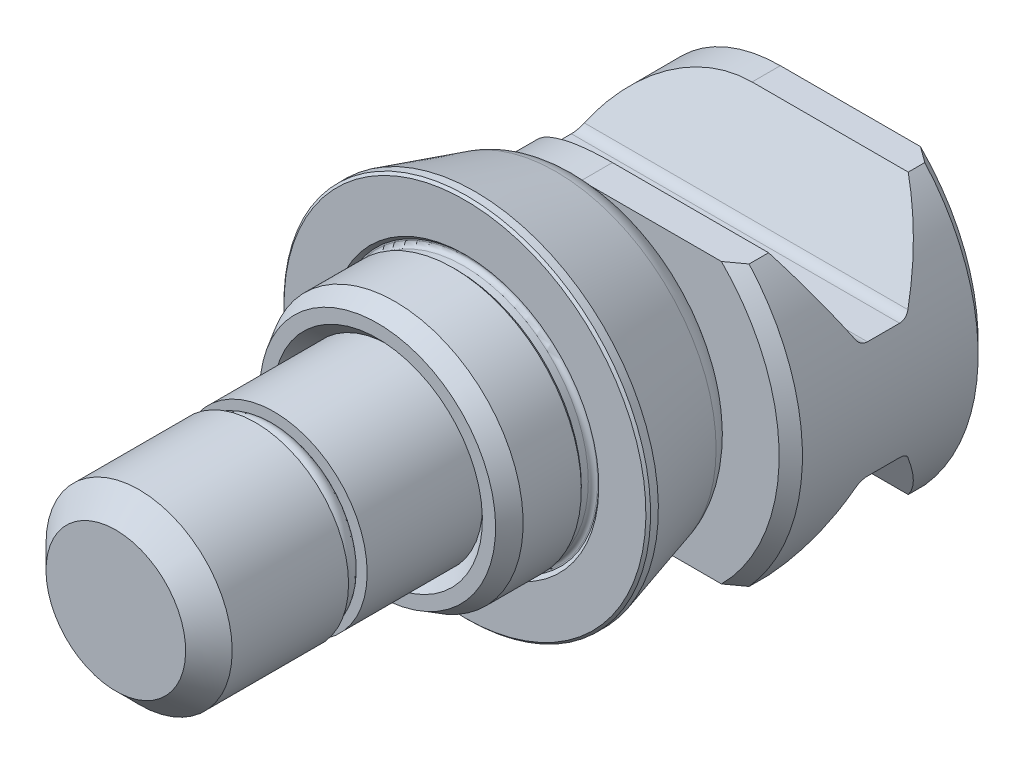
ISO-10303-21;
HEADER;
FILE_DESCRIPTION(('STEP AP214'),'2;1');
FILE_NAME('part.step','',(''),(''),'','','');
FILE_SCHEMA(('AUTOMOTIVE_DESIGN { 1 0 10303 214 1 1 1 1 }'));
ENDSEC;
DATA;
#1=APPLICATION_CONTEXT('core data for automotive mechanical design processes');
#2=APPLICATION_PROTOCOL_DEFINITION('international standard','automotive_design',2000,#1);
#3=PRODUCT_CONTEXT('',#1,'mechanical');
#4=PRODUCT('Part','Part','',(#3));
#5=PRODUCT_RELATED_PRODUCT_CATEGORY('part','',(#4));
#6=PRODUCT_DEFINITION_FORMATION('','',#4);
#7=PRODUCT_DEFINITION_CONTEXT('part definition',#1,'design');
#8=PRODUCT_DEFINITION('design','',#6,#7);
#9=PRODUCT_DEFINITION_SHAPE('','',#8);
#10=(LENGTH_UNIT() NAMED_UNIT(*) SI_UNIT(.MILLI.,.METRE.));
#11=(NAMED_UNIT(*) PLANE_ANGLE_UNIT() SI_UNIT($,.RADIAN.));
#12=(NAMED_UNIT(*) SI_UNIT($,.STERADIAN.) SOLID_ANGLE_UNIT());
#13=UNCERTAINTY_MEASURE_WITH_UNIT(LENGTH_MEASURE(1.E-05),#10,'distance_accuracy_value','');
#14=(GEOMETRIC_REPRESENTATION_CONTEXT(3) GLOBAL_UNCERTAINTY_ASSIGNED_CONTEXT((#13)) GLOBAL_UNIT_ASSIGNED_CONTEXT((#10,
#11,#12)) REPRESENTATION_CONTEXT('',''));
#15=CARTESIAN_POINT('',(0.,0.,0.));
#16=DIRECTION('',(0.,0.,1.));
#17=DIRECTION('',(1.,0.,0.));
#18=AXIS2_PLACEMENT_3D('',#15,#16,#17);
#19=CARTESIAN_POINT('',(6.75,0.,17.15));
#20=DIRECTION('',(0.,-1.,0.));
#21=DIRECTION('',(0.,0.,1.));
#22=AXIS2_PLACEMENT_3D('',#19,#20,#21);
#23=ELLIPSE('',#22,0.75,0.75);
#24=CARTESIAN_POINT('',(0.,0.,17.15));
#25=DIRECTION('',(0.,0.,-1.));
#26=AXIS1_PLACEMENT('',#24,#25);
#27=SURFACE_OF_REVOLUTION('',#23,#26);
#28=CARTESIAN_POINT('',(0.,0.,17.4));
#29=DIRECTION('',(0.,0.,-1.));
#30=DIRECTION('',(0.,1.,0.));
#31=AXIS2_PLACEMENT_3D('',#28,#29,#30);
#32=CIRCLE('',#31,6.04289321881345);
#33=CARTESIAN_POINT('',(0.,6.04289321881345,17.4));
#34=VERTEX_POINT('',#33);
#35=EDGE_CURVE('E9',#34,#34,#32,.F.);
#36=ORIENTED_EDGE('',*,*,#35,.F.);
#37=EDGE_LOOP('',(#36));
#38=FACE_BOUND('',#37,.T.);
#39=CARTESIAN_POINT('',(0.,0.,16.4));
#40=DIRECTION('',(0.,0.,-1.));
#41=DIRECTION('',(0.,1.,0.));
#42=AXIS2_PLACEMENT_3D('',#39,#40,#41);
#43=CIRCLE('',#42,6.75);
#44=CARTESIAN_POINT('',(0.,6.75,16.4));
#45=VERTEX_POINT('',#44);
#46=EDGE_CURVE('E24',#45,#45,#43,.T.);
#47=ORIENTED_EDGE('',*,*,#46,.F.);
#48=EDGE_LOOP('',(#47));
#49=FACE_BOUND('',#48,.T.);
#50=ADVANCED_FACE('F14',(#38,#49),#27,.F.);
#51=CARTESIAN_POINT('',(0.,-15.,-27.));
#52=DIRECTION('',(0.,0.,1.));
#53=DIRECTION('',(0.,1.,0.));
#54=AXIS2_PLACEMENT_3D('',#51,#52,#53);
#55=PLANE('',#54);
#56=DIRECTION('',(0.,1.,0.));
#57=VECTOR('',#56,1.);
#58=CARTESIAN_POINT('',(0.,-7.,-27.));
#59=LINE('',#58,#57);
#60=CARTESIAN_POINT('',(0.,-7.,-27.));
#61=VERTEX_POINT('',#60);
#62=CARTESIAN_POINT('',(0.,-3.,-27.));
#63=VERTEX_POINT('',#62);
#64=EDGE_CURVE('E187',#61,#63,#59,.T.);
#65=ORIENTED_EDGE('',*,*,#64,.F.);
#66=DIRECTION('',(0.707106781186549,-0.707106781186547,0.));
#67=VECTOR('',#66,1.);
#68=CARTESIAN_POINT('',(-7.,0.,-27.));
#69=LINE('',#68,#67);
#70=CARTESIAN_POINT('',(-7.,0.,-27.));
#71=VERTEX_POINT('',#70);
#72=EDGE_CURVE('E198',#71,#61,#69,.T.);
#73=ORIENTED_EDGE('',*,*,#72,.F.);
#74=DIRECTION('',(-0.707106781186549,-0.707106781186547,0.));
#75=VECTOR('',#74,1.);
#76=CARTESIAN_POINT('',(0.,7.,-27.));
#77=LINE('',#76,#75);
#78=CARTESIAN_POINT('',(0.,7.,-27.));
#79=VERTEX_POINT('',#78);
#80=EDGE_CURVE('E207',#79,#71,#77,.T.);
#81=ORIENTED_EDGE('',*,*,#80,.F.);
#82=DIRECTION('',(0.,1.,0.));
#83=VECTOR('',#82,1.);
#84=CARTESIAN_POINT('',(0.,3.,-27.));
#85=LINE('',#84,#83);
#86=CARTESIAN_POINT('',(0.,3.,-27.));
#87=VERTEX_POINT('',#86);
#88=EDGE_CURVE('E212',#87,#79,#85,.T.);
#89=ORIENTED_EDGE('',*,*,#88,.F.);
#90=DIRECTION('',(-1.,0.,0.));
#91=VECTOR('',#90,1.);
#92=CARTESIAN_POINT('',(10.,3.,-27.));
#93=LINE('',#92,#91);
#94=CARTESIAN_POINT('',(10.,3.,-27.));
#95=VERTEX_POINT('',#94);
#96=EDGE_CURVE('E220',#95,#87,#93,.T.);
#97=ORIENTED_EDGE('',*,*,#96,.F.);
#98=DIRECTION('',(0.,1.,0.));
#99=VECTOR('',#98,1.);
#100=CARTESIAN_POINT('',(10.,-3.,-27.));
#101=LINE('',#100,#99);
#102=CARTESIAN_POINT('',(10.,-3.,-27.));
#103=VERTEX_POINT('',#102);
#104=EDGE_CURVE('E223',#103,#95,#101,.T.);
#105=ORIENTED_EDGE('',*,*,#104,.F.);
#106=DIRECTION('',(1.,0.,0.));
#107=VECTOR('',#106,1.);
#108=CARTESIAN_POINT('',(0.,-3.,-27.));
#109=LINE('',#108,#107);
#110=EDGE_CURVE('E201',#63,#103,#109,.T.);
#111=ORIENTED_EDGE('',*,*,#110,.F.);
#112=EDGE_LOOP('',(#65,#73,#81,#89,#97,#105,#111));
#113=FACE_BOUND('',#112,.T.);
#114=ADVANCED_FACE('F197',(#113),#55,.F.);
#115=CARTESIAN_POINT('',(0.,-7.,-4.87728445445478));
#116=DIRECTION('',(-1.,0.,0.));
#117=DIRECTION('',(0.,-1.,0.));
#118=AXIS2_PLACEMENT_3D('',#115,#116,#117);
#119=PLANE('',#118);
#120=DIRECTION('',(0.,-1.,0.));
#121=VECTOR('',#120,1.);
#122=CARTESIAN_POINT('',(0.,-15.,-27.1));
#123=LINE('',#122,#121);
#124=CARTESIAN_POINT('',(0.,-3.,-27.1));
#125=VERTEX_POINT('',#124);
#126=CARTESIAN_POINT('',(0.,-7.,-27.1));
#127=VERTEX_POINT('',#126);
#128=EDGE_CURVE('E189',#125,#127,#123,.T.);
#129=ORIENTED_EDGE('',*,*,#128,.T.);
#130=DIRECTION('',(0.,0.,-1.));
#131=VECTOR('',#130,1.);
#132=CARTESIAN_POINT('',(0.,-7.,-4.87728445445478));
#133=LINE('',#132,#131);
#134=EDGE_CURVE('E184',#61,#127,#133,.T.);
#135=ORIENTED_EDGE('',*,*,#134,.F.);
#136=ORIENTED_EDGE('',*,*,#64,.T.);
#137=DIRECTION('',(0.,0.,-1.));
#138=VECTOR('',#137,1.);
#139=CARTESIAN_POINT('',(0.,-3.,-4.87728445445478));
#140=LINE('',#139,#138);
#141=EDGE_CURVE('E32',#63,#125,#140,.T.);
#142=ORIENTED_EDGE('',*,*,#141,.T.);
#143=EDGE_LOOP('',(#129,#135,#136,#142));
#144=FACE_BOUND('',#143,.T.);
#145=ADVANCED_FACE('F186',(#144),#119,.T.);
#146=CARTESIAN_POINT('',(-7.,0.,-4.87728445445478));
#147=DIRECTION('',(0.707106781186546,0.707106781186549,0.));
#148=DIRECTION('',(-0.707106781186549,0.707106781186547,0.));
#149=AXIS2_PLACEMENT_3D('',#146,#147,#148);
#150=PLANE('',#149);
#151=DIRECTION('',(-0.707106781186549,0.707106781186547,0.));
#152=VECTOR('',#151,1.);
#153=CARTESIAN_POINT('',(4.,-11.,-27.1));
#154=LINE('',#153,#152);
#155=CARTESIAN_POINT('',(-7.,0.,-27.1));
#156=VERTEX_POINT('',#155);
#157=EDGE_CURVE('E479',#127,#156,#154,.T.);
#158=ORIENTED_EDGE('',*,*,#157,.T.);
#159=DIRECTION('',(0.,0.,-1.));
#160=VECTOR('',#159,1.);
#161=CARTESIAN_POINT('',(-7.,0.,-4.87728445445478));
#162=LINE('',#161,#160);
#163=EDGE_CURVE('E193',#71,#156,#162,.T.);
#164=ORIENTED_EDGE('',*,*,#163,.F.);
#165=ORIENTED_EDGE('',*,*,#72,.T.);
#166=ORIENTED_EDGE('',*,*,#134,.T.);
#167=EDGE_LOOP('',(#158,#164,#165,#166));
#168=FACE_BOUND('',#167,.T.);
#169=ADVANCED_FACE('F203',(#168),#150,.T.);
#170=CARTESIAN_POINT('',(0.,7.,-4.87728445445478));
#171=DIRECTION('',(0.707106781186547,-0.707106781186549,0.));
#172=DIRECTION('',(0.707106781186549,0.707106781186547,0.));
#173=AXIS2_PLACEMENT_3D('',#170,#171,#172);
#174=PLANE('',#173);
#175=DIRECTION('',(0.707106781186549,0.707106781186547,0.));
#176=VECTOR('',#175,1.);
#177=CARTESIAN_POINT('',(-11.,-4.,-27.1));
#178=LINE('',#177,#176);
#179=CARTESIAN_POINT('',(0.,7.,-27.1));
#180=VERTEX_POINT('',#179);
#181=EDGE_CURVE('E481',#156,#180,#178,.T.);
#182=ORIENTED_EDGE('',*,*,#181,.T.);
#183=DIRECTION('',(0.,0.,-1.));
#184=VECTOR('',#183,1.);
#185=CARTESIAN_POINT('',(0.,7.,-4.87728445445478));
#186=LINE('',#185,#184);
#187=EDGE_CURVE('E236',#79,#180,#186,.T.);
#188=ORIENTED_EDGE('',*,*,#187,.F.);
#189=ORIENTED_EDGE('',*,*,#80,.T.);
#190=ORIENTED_EDGE('',*,*,#163,.T.);
#191=EDGE_LOOP('',(#182,#188,#189,#190));
#192=FACE_BOUND('',#191,.T.);
#193=ADVANCED_FACE('F613',(#192),#174,.T.);
#194=CARTESIAN_POINT('',(0.,3.,-4.87728445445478));
#195=DIRECTION('',(-1.,0.,0.));
#196=DIRECTION('',(0.,-1.,0.));
#197=AXIS2_PLACEMENT_3D('',#194,#195,#196);
#198=PLANE('',#197);
#199=DIRECTION('',(0.,-1.,0.));
#200=VECTOR('',#199,1.);
#201=CARTESIAN_POINT('',(0.,-15.,-27.1));
#202=LINE('',#201,#200);
#203=CARTESIAN_POINT('',(0.,3.,-27.1));
#204=VERTEX_POINT('',#203);
#205=EDGE_CURVE('E483',#180,#204,#202,.T.);
#206=ORIENTED_EDGE('',*,*,#205,.T.);
#207=DIRECTION('',(0.,0.,-1.));
#208=VECTOR('',#207,1.);
#209=CARTESIAN_POINT('',(0.,3.,-4.87728445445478));
#210=LINE('',#209,#208);
#211=EDGE_CURVE('E233',#87,#204,#210,.T.);
#212=ORIENTED_EDGE('',*,*,#211,.F.);
#213=ORIENTED_EDGE('',*,*,#88,.T.);
#214=ORIENTED_EDGE('',*,*,#187,.T.);
#215=EDGE_LOOP('',(#206,#212,#213,#214));
#216=FACE_BOUND('',#215,.T.);
#217=ADVANCED_FACE('F616',(#216),#198,.T.);
#218=CARTESIAN_POINT('',(10.,3.,-4.87728445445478));
#219=DIRECTION('',(0.,-1.,0.));
#220=DIRECTION('',(1.,0.,0.));
#221=AXIS2_PLACEMENT_3D('',#218,#219,#220);
#222=PLANE('',#221);
#223=DIRECTION('',(1.,0.,0.));
#224=VECTOR('',#223,1.);
#225=CARTESIAN_POINT('',(0.,3.,-27.1));
#226=LINE('',#225,#224);
#227=CARTESIAN_POINT('',(10.,3.,-27.1));
#228=VERTEX_POINT('',#227);
#229=EDGE_CURVE('E485',#204,#228,#226,.T.);
#230=ORIENTED_EDGE('',*,*,#229,.T.);
#231=DIRECTION('',(0.,0.,-1.));
#232=VECTOR('',#231,1.);
#233=CARTESIAN_POINT('',(10.,3.,-4.87728445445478));
#234=LINE('',#233,#232);
#235=EDGE_CURVE('E230',#95,#228,#234,.T.);
#236=ORIENTED_EDGE('',*,*,#235,.F.);
#237=ORIENTED_EDGE('',*,*,#96,.T.);
#238=ORIENTED_EDGE('',*,*,#211,.T.);
#239=EDGE_LOOP('',(#230,#236,#237,#238));
#240=FACE_BOUND('',#239,.T.);
#241=ADVANCED_FACE('F620',(#240),#222,.T.);
#242=CARTESIAN_POINT('',(10.,-3.,-4.87728445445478));
#243=DIRECTION('',(-1.,0.,0.));
#244=DIRECTION('',(0.,-1.,0.));
#245=AXIS2_PLACEMENT_3D('',#242,#243,#244);
#246=PLANE('',#245);
#247=DIRECTION('',(0.,-1.,0.));
#248=VECTOR('',#247,1.);
#249=CARTESIAN_POINT('',(10.,-15.,-27.1));
#250=LINE('',#249,#248);
#251=CARTESIAN_POINT('',(10.,-3.,-27.1));
#252=VERTEX_POINT('',#251);
#253=EDGE_CURVE('E487',#228,#252,#250,.T.);
#254=ORIENTED_EDGE('',*,*,#253,.T.);
#255=DIRECTION('',(0.,0.,-1.));
#256=VECTOR('',#255,1.);
#257=CARTESIAN_POINT('',(10.,-3.,-4.87728445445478));
#258=LINE('',#257,#256);
#259=EDGE_CURVE('E227',#103,#252,#258,.T.);
#260=ORIENTED_EDGE('',*,*,#259,.F.);
#261=ORIENTED_EDGE('',*,*,#104,.T.);
#262=ORIENTED_EDGE('',*,*,#235,.T.);
#263=EDGE_LOOP('',(#254,#260,#261,#262));
#264=FACE_BOUND('',#263,.T.);
#265=ADVANCED_FACE('F624',(#264),#246,.T.);
#266=CARTESIAN_POINT('',(0.,-3.,-4.87728445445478));
#267=DIRECTION('',(0.,1.,0.));
#268=DIRECTION('',(-1.,0.,0.));
#269=AXIS2_PLACEMENT_3D('',#266,#267,#268);
#270=PLANE('',#269);
#271=DIRECTION('',(-1.,0.,0.));
#272=VECTOR('',#271,1.);
#273=CARTESIAN_POINT('',(0.,-3.,-27.1));
#274=LINE('',#273,#272);
#275=EDGE_CURVE('E488',#252,#125,#274,.T.);
#276=ORIENTED_EDGE('',*,*,#275,.T.);
#277=ORIENTED_EDGE('',*,*,#141,.F.);
#278=ORIENTED_EDGE('',*,*,#110,.T.);
#279=ORIENTED_EDGE('',*,*,#259,.T.);
#280=EDGE_LOOP('',(#276,#277,#278,#279));
#281=FACE_BOUND('',#280,.T.);
#282=ADVANCED_FACE('F628',(#281),#270,.T.);
#283=CARTESIAN_POINT('',(0.,0.,-27.1));
#284=DIRECTION('',(0.,0.,1.));
#285=DIRECTION('',(0.,1.,0.));
#286=AXIS2_PLACEMENT_3D('',#283,#284,#285);
#287=CONICAL_SURFACE('',#286,17.,0.785398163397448);
#288=CARTESIAN_POINT('',(13.4164078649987,12.,-26.1));
#289=CARTESIAN_POINT('',(13.3028148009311,12.,-26.1846666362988));
#290=CARTESIAN_POINT('',(13.188993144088,12.,-26.2690270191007));
#291=CARTESIAN_POINT('',(12.9608737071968,12.,-26.4370927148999));
#292=CARTESIAN_POINT('',(12.8465759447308,12.,-26.5207980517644));
#293=CARTESIAN_POINT('',(12.6174766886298,12.,-26.6875175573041));
#294=CARTESIAN_POINT('',(12.5026751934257,12.,-26.7705317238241));
#295=CARTESIAN_POINT('',(12.272539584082,12.,-26.9358273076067));
#296=CARTESIAN_POINT('',(12.1572054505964,12.,-27.0181086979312));
#297=CARTESIAN_POINT('',(12.0415945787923,12.,-27.1));
#298=B_SPLINE_CURVE_WITH_KNOTS('',3,(#288,#289,#290,#291,#292,#293,#294,#295,#296,#297),
.UNSPECIFIED.,.F.,.F.,(4,2,2,2,4),(0.,0.425025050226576,0.850034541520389,1.27504535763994,
1.70007173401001),.UNSPECIFIED.);
#299=CARTESIAN_POINT('',(13.4164078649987,12.,-26.1));
#300=VERTEX_POINT('',#299);
#301=CARTESIAN_POINT('',(12.0415945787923,12.,-27.1));
#302=VERTEX_POINT('',#301);
#303=EDGE_CURVE('E471',#300,#302,#298,.T.);
#304=ORIENTED_EDGE('',*,*,#303,.F.);
#305=CARTESIAN_POINT('',(0.,0.,-26.1));
#306=DIRECTION('',(0.,0.,1.));
#307=DIRECTION('',(0.,1.,0.));
#308=AXIS2_PLACEMENT_3D('',#305,#306,#307);
#309=CIRCLE('',#308,18.);
#310=CARTESIAN_POINT('',(13.4164078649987,-12.,-26.1));
#311=VERTEX_POINT('',#310);
#312=EDGE_CURVE('E40',#311,#300,#309,.T.);
#313=ORIENTED_EDGE('',*,*,#312,.F.);
#314=CARTESIAN_POINT('',(12.0415945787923,-12.,-27.1));
#315=CARTESIAN_POINT('',(12.1572054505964,-12.,-27.0181086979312));
#316=CARTESIAN_POINT('',(12.272539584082,-12.,-26.9358273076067));
#317=CARTESIAN_POINT('',(12.5026751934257,-12.,-26.7705317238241));
#318=CARTESIAN_POINT('',(12.6174766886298,-12.,-26.6875175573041));
#319=CARTESIAN_POINT('',(12.8465759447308,-12.,-26.5207980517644));
#320=CARTESIAN_POINT('',(12.9608737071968,-12.,-26.4370927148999));
#321=CARTESIAN_POINT('',(13.188993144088,-12.,-26.2690270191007));
#322=CARTESIAN_POINT('',(13.3028148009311,-12.,-26.1846666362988));
#323=CARTESIAN_POINT('',(13.4164078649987,-12.,-26.1));
#324=B_SPLINE_CURVE_WITH_KNOTS('',3,(#314,#315,#316,#317,#318,#319,#320,#321,#322,#323),
.UNSPECIFIED.,.F.,.F.,(4,2,2,2,4),(0.,0.425026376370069,0.850037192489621,1.27504668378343,
1.70007173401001),.UNSPECIFIED.);
#325=CARTESIAN_POINT('',(12.0415945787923,-12.,-27.1));
#326=VERTEX_POINT('',#325);
#327=EDGE_CURVE('E688',#326,#311,#324,.T.);
#328=ORIENTED_EDGE('',*,*,#327,.F.);
#329=CARTESIAN_POINT('',(0.,0.,-27.1));
#330=DIRECTION('',(0.,0.,1.));
#331=DIRECTION('',(0.,1.,0.));
#332=AXIS2_PLACEMENT_3D('',#329,#330,#331);
#333=CIRCLE('',#332,17.);
#334=EDGE_CURVE('E458',#302,#326,#333,.F.);
#335=ORIENTED_EDGE('',*,*,#334,.F.);
#336=EDGE_LOOP('',(#304,#313,#328,#335));
#337=FACE_BOUND('',#336,.T.);
#338=ADVANCED_FACE('F16',(#337),#287,.T.);
#339=CARTESIAN_POINT('',(25.,6.,-20.056624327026));
#340=DIRECTION('',(1.,0.,0.));
#341=DIRECTION('',(0.,1.,0.));
#342=AXIS2_PLACEMENT_3D('',#339,#340,#341);
#343=CYLINDRICAL_SURFACE('',#342,1.);
#344=CARTESIAN_POINT('',(17.1391365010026,5.5,-20.9226497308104));
#345=CARTESIAN_POINT('',(17.1468134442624,5.47607777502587,-20.9088379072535));
#346=CARTESIAN_POINT('',(17.1542650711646,5.45268396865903,-20.8940092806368));
#347=CARTESIAN_POINT('',(17.1686862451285,5.40710483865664,-20.8623822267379));
#348=CARTESIAN_POINT('',(17.1756557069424,5.38491972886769,-20.8455834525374));
#349=CARTESIAN_POINT('',(17.1957772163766,5.32045742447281,-20.7923685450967));
#350=CARTESIAN_POINT('',(17.2081567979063,5.28022815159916,-20.7531078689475));
#351=CARTESIAN_POINT('',(17.2305783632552,5.2065978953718,-20.6679269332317));
#352=CARTESIAN_POINT('',(17.2406155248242,5.17321101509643,-20.6219932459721));
#353=CARTESIAN_POINT('',(17.2581078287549,5.11455292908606,-20.5248160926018));
#354=CARTESIAN_POINT('',(17.2655651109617,5.08927499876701,-20.4735770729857));
#355=CARTESIAN_POINT('',(17.27824135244,5.04608091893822,-20.3629431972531));
#356=CARTESIAN_POINT('',(17.2832337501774,5.02891472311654,-20.3032238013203));
#357=CARTESIAN_POINT('',(17.2882514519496,5.01162584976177,-20.2118374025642));
#358=CARTESIAN_POINT('',(17.2895122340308,5.00727274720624,-20.1809773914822));
#359=CARTESIAN_POINT('',(17.2911945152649,5.00145947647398,-20.1189598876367));
#360=CARTESIAN_POINT('',(17.2916159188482,4.99999963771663,-20.0878023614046));
#361=CARTESIAN_POINT('',(17.2916164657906,5.,-20.056624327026));
#362=B_SPLINE_CURVE_WITH_KNOTS('',3,(#344,#345,#346,#347,#348,#349,#350,#351,#352,#353,#354,
#355,#356,#357,#358,#359,#360,#361),.UNSPECIFIED.,.F.,.F.,(4,2,2,2,2,2,2,2,4),(0.,
0.085962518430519,0.17194019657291,0.343735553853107,0.515881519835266,0.687884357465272,
0.873635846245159,0.967081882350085,1.06053855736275),.UNSPECIFIED.);
#363=CARTESIAN_POINT('',(17.1391365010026,5.5,-20.9226497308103));
#364=VERTEX_POINT('',#363);
#365=CARTESIAN_POINT('',(17.2916164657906,5.,-20.056624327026));
#366=VERTEX_POINT('',#365);
#367=EDGE_CURVE('E352',#364,#366,#362,.T.);
#368=ORIENTED_EDGE('',*,*,#367,.F.);
#369=DIRECTION('',(-1.,0.,0.));
#370=VECTOR('',#369,1.);
#371=CARTESIAN_POINT('',(17.2916164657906,5.5,-20.9226497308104));
#372=LINE('',#371,#370);
#373=CARTESIAN_POINT('',(-10.6653645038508,5.5,-20.9226497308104));
#374=VERTEX_POINT('',#373);
#375=EDGE_CURVE('E329',#374,#364,#372,.F.);
#376=ORIENTED_EDGE('',*,*,#375,.F.);
#377=CARTESIAN_POINT('',(-10.9087121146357,5.,-20.056624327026));
#378=CARTESIAN_POINT('',(-10.9087119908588,4.99999901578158,-20.0828050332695));
#379=CARTESIAN_POINT('',(-10.9082405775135,5.00102890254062,-20.1089726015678));
#380=CARTESIAN_POINT('',(-10.9063598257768,5.00512966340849,-20.1611082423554));
#381=CARTESIAN_POINT('',(-10.9049506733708,5.0082001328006,-20.187076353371));
#382=CARTESIAN_POINT('',(-10.8993375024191,5.02041102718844,-20.2642421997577));
#383=CARTESIAN_POINT('',(-10.8937476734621,5.03255129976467,-20.3149021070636));
#384=CARTESIAN_POINT('',(-10.8790192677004,5.06431057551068,-20.4132166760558));
#385=CARTESIAN_POINT('',(-10.8698816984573,5.08392745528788,-20.460872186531));
#386=CARTESIAN_POINT('',(-10.848284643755,5.12985004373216,-20.5520481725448));
#387=CARTESIAN_POINT('',(-10.8358234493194,5.1561591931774,-20.5955665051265));
#388=CARTESIAN_POINT('',(-10.8074414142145,5.21539261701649,-20.6787847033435));
#389=CARTESIAN_POINT('',(-10.791423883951,5.24849930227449,-20.7183209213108));
#390=CARTESIAN_POINT('',(-10.7565491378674,5.31960642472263,-20.7912367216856));
#391=CARTESIAN_POINT('',(-10.7376929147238,5.35760515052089,-20.8246184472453));
#392=CARTESIAN_POINT('',(-10.7093127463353,5.41396025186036,-20.8671724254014));
#393=CARTESIAN_POINT('',(-10.700780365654,5.43080742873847,-20.8790856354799));
#394=CARTESIAN_POINT('',(-10.6833469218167,5.46502205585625,-20.9017383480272));
#395=CARTESIAN_POINT('',(-10.6744467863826,5.48238816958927,-20.9124805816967));
#396=CARTESIAN_POINT('',(-10.6653645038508,5.5,-20.9226497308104));
#397=B_SPLINE_CURVE_WITH_KNOTS('',3,(#377,#378,#379,#380,#381,#382,#383,#384,#385,#386,#387,
#388,#389,#390,#391,#392,#393,#394,#395,#396),.UNSPECIFIED.,.F.,.F.,(4,2,2,2,2,2,2,2,2,4),(0.,
0.0784918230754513,0.156968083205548,0.313326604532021,0.469640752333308,0.62603543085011,
0.787360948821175,0.948630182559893,1.01558382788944,1.08237780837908),.UNSPECIFIED.);
#398=CARTESIAN_POINT('',(-10.9087121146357,5.,-20.056624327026));
#399=VERTEX_POINT('',#398);
#400=EDGE_CURVE('E344',#399,#374,#397,.T.);
#401=ORIENTED_EDGE('',*,*,#400,.F.);
#402=DIRECTION('',(-1.,0.,0.));
#403=VECTOR('',#402,1.);
#404=CARTESIAN_POINT('',(-10.9087121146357,5.,-20.056624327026));
#405=LINE('',#404,#403);
#406=EDGE_CURVE('E326',#366,#399,#405,.T.);
#407=ORIENTED_EDGE('',*,*,#406,.F.);
#408=EDGE_LOOP('',(#368,#376,#401,#407));
#409=FACE_BOUND('',#408,.T.);
#410=ADVANCED_FACE('F363',(#409),#343,.F.);
#411=CARTESIAN_POINT('',(25.,5.,-16.7168783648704));
#412=DIRECTION('',(0.,1.,0.));
#413=DIRECTION('',(0.,0.,-1.));
#414=AXIS2_PLACEMENT_3D('',#411,#412,#413);
#415=PLANE('',#414);
#416=DIRECTION('',(0.,0.,-1.));
#417=VECTOR('',#416,1.);
#418=CARTESIAN_POINT('',(17.2916164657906,5.,-10.));
#419=LINE('',#418,#417);
#420=CARTESIAN_POINT('',(17.2916164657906,5.,-17.2942286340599));
#421=VERTEX_POINT('',#420);
#422=EDGE_CURVE('E318',#366,#421,#419,.F.);
#423=ORIENTED_EDGE('',*,*,#422,.F.);
#424=ORIENTED_EDGE('',*,*,#406,.T.);
#425=DIRECTION('',(0.,0.,1.));
#426=VECTOR('',#425,1.);
#427=CARTESIAN_POINT('',(-10.9087121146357,5.,-51.));
#428=LINE('',#427,#426);
#429=CARTESIAN_POINT('',(-10.9087121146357,5.,-17.2942286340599));
#430=VERTEX_POINT('',#429);
#431=EDGE_CURVE('E261',#399,#430,#428,.T.);
#432=ORIENTED_EDGE('',*,*,#431,.T.);
#433=DIRECTION('',(-1.,0.,0.));
#434=VECTOR('',#433,1.);
#435=CARTESIAN_POINT('',(17.2916164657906,5.,-17.2942286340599));
#436=LINE('',#435,#434);
#437=EDGE_CURVE('E324',#430,#421,#436,.F.);
#438=ORIENTED_EDGE('',*,*,#437,.T.);
#439=EDGE_LOOP('',(#423,#424,#432,#438));
#440=FACE_BOUND('',#439,.T.);
#441=ADVANCED_FACE('F368',(#440),#415,.T.);
#442=CARTESIAN_POINT('',(25.,6.,-17.2942286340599));
#443=DIRECTION('',(1.,0.,0.));
#444=DIRECTION('',(0.,1.,0.));
#445=AXIS2_PLACEMENT_3D('',#442,#443,#444);
#446=CYLINDRICAL_SURFACE('',#445,1.);
#447=CARTESIAN_POINT('',(17.2916164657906,5.,-17.2942286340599));
#448=CARTESIAN_POINT('',(17.291616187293,4.99999964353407,-17.2669410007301));
#449=CARTESIAN_POINT('',(17.2912933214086,5.00111767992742,-17.2396666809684));
#450=CARTESIAN_POINT('',(17.2900038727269,5.00557429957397,-17.1853184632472));
#451=CARTESIAN_POINT('',(17.2890373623,5.00891263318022,-17.1582445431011));
#452=CARTESIAN_POINT('',(17.2851817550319,5.02220888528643,-17.0777275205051));
#453=CARTESIAN_POINT('',(17.2813365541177,5.03544827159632,-17.0248322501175));
#454=CARTESIAN_POINT('',(17.2711655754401,5.07022323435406,-16.9221271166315));
#455=CARTESIAN_POINT('',(17.2648395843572,5.09175952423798,-16.8723175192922));
#456=CARTESIAN_POINT('',(17.2498202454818,5.14241151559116,-16.7770720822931));
#457=CARTESIAN_POINT('',(17.2411257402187,5.17153092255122,-16.731638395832));
#458=CARTESIAN_POINT('',(17.2213892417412,5.23688208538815,-16.6456823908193));
#459=CARTESIAN_POINT('',(17.2103137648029,5.2732146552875,-16.6052446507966));
#460=CARTESIAN_POINT('',(17.1861248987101,5.35152097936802,-16.5310941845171));
#461=CARTESIAN_POINT('',(17.1730143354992,5.39348690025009,-16.4973722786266));
#462=CARTESIAN_POINT('',(17.1525775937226,5.45798018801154,-16.4534992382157));
#463=CARTESIAN_POINT('',(17.1459432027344,5.47879086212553,-16.4404414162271));
#464=CARTESIAN_POINT('',(17.1391365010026,5.5,-16.4282032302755));
#465=B_SPLINE_CURVE_WITH_KNOTS('',3,(#447,#448,#449,#450,#451,#452,#453,#454,#455,#456,#457,
#458,#459,#460,#461,#462,#463,#464),.UNSPECIFIED.,.F.,.F.,(4,2,2,2,2,2,2,2,4),(0.,
0.0818117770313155,0.163614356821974,0.326754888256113,0.489909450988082,0.653143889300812,
0.81884466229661,0.984317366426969,1.06058686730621),.UNSPECIFIED.);
#466=CARTESIAN_POINT('',(17.1391365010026,5.5,-16.4282032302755));
#467=VERTEX_POINT('',#466);
#468=EDGE_CURVE('E388',#421,#467,#465,.T.);
#469=ORIENTED_EDGE('',*,*,#468,.F.);
#470=ORIENTED_EDGE('',*,*,#437,.F.);
#471=CARTESIAN_POINT('',(-10.6653645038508,5.5,-16.4282032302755));
#472=CARTESIAN_POINT('',(-10.6774347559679,5.47659477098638,-16.4417173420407));
#473=CARTESIAN_POINT('',(-10.6891836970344,5.45362151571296,-16.4562460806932));
#474=CARTESIAN_POINT('',(-10.7119857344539,5.40869623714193,-16.4873163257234));
#475=CARTESIAN_POINT('',(-10.7230384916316,5.38674471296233,-16.5038588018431));
#476=CARTESIAN_POINT('',(-10.7550987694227,5.32260575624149,-16.5565320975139));
#477=CARTESIAN_POINT('',(-10.7749588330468,5.28223029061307,-16.5956537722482));
#478=CARTESIAN_POINT('',(-10.8110922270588,5.20787932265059,-16.6812277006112));
#479=CARTESIAN_POINT('',(-10.8273544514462,5.17392368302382,-16.7277019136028));
#480=CARTESIAN_POINT('',(-10.8557255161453,5.11412973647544,-16.8267152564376));
#481=CARTESIAN_POINT('',(-10.8678390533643,5.08828225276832,-16.879247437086));
#482=CARTESIAN_POINT('',(-10.8868237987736,5.04752786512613,-16.9847697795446));
#483=CARTESIAN_POINT('',(-10.8940116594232,5.03196310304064,-17.0374500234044));
#484=CARTESIAN_POINT('',(-10.9042731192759,5.00968918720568,-17.144960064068));
#485=CARTESIAN_POINT('',(-10.9073566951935,5.00295855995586,-17.1997843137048));
#486=CARTESIAN_POINT('',(-10.9085935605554,5.00025823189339,-17.2679013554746));
#487=CARTESIAN_POINT('',(-10.9087129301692,4.99999754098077,-17.2810680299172));
#488=CARTESIAN_POINT('',(-10.9087121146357,5.,-17.2942286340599));
#489=B_SPLINE_CURVE_WITH_KNOTS('',3,(#471,#472,#473,#474,#475,#476,#477,#478,#479,#480,#481,
#482,#483,#484,#485,#486,#487,#488),.UNSPECIFIED.,.F.,.F.,(4,2,2,2,2,2,2,2,4),(0.,
0.0887543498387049,0.177551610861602,0.355506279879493,0.534002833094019,0.712296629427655,
0.877651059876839,1.04260280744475,1.08209840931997),.UNSPECIFIED.);
#490=CARTESIAN_POINT('',(-10.6653645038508,5.5,-16.4282032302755));
#491=VERTEX_POINT('',#490);
#492=EDGE_CURVE('E382',#491,#430,#489,.T.);
#493=ORIENTED_EDGE('',*,*,#492,.F.);
#494=DIRECTION('',(-1.,0.,0.));
#495=VECTOR('',#494,1.);
#496=CARTESIAN_POINT('',(-10.9087121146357,5.5,-16.4282032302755));
#497=LINE('',#496,#495);
#498=EDGE_CURVE('E331',#467,#491,#497,.T.);
#499=ORIENTED_EDGE('',*,*,#498,.F.);
#500=EDGE_LOOP('',(#469,#470,#493,#499));
#501=FACE_BOUND('',#500,.T.);
#502=ADVANCED_FACE('F372',(#501),#446,.F.);
#503=CARTESIAN_POINT('',(25.,-6.,-17.2942286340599));
#504=DIRECTION('',(1.,0.,0.));
#505=DIRECTION('',(0.,1.,0.));
#506=AXIS2_PLACEMENT_3D('',#503,#504,#505);
#507=CYLINDRICAL_SURFACE('',#506,1.);
#508=CARTESIAN_POINT('',(17.1391365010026,-5.5,-16.4282032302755));
#509=CARTESIAN_POINT('',(17.1468134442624,-5.47607777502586,-16.4420150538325));
#510=CARTESIAN_POINT('',(17.1542650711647,-5.45268396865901,-16.4568436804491));
#511=CARTESIAN_POINT('',(17.1686862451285,-5.40710483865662,-16.488470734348));
#512=CARTESIAN_POINT('',(17.1756557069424,-5.38491972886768,-16.5052695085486));
#513=CARTESIAN_POINT('',(17.1957772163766,-5.3204574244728,-16.5584844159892));
#514=CARTESIAN_POINT('',(17.2081567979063,-5.28022815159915,-16.5977450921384));
#515=CARTESIAN_POINT('',(17.2305783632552,-5.2065978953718,-16.6829260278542));
#516=CARTESIAN_POINT('',(17.2406155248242,-5.17321101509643,-16.7288597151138));
#517=CARTESIAN_POINT('',(17.2581078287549,-5.11455292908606,-16.8260368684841));
#518=CARTESIAN_POINT('',(17.2655651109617,-5.08927499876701,-16.8772758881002));
#519=CARTESIAN_POINT('',(17.27824135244,-5.04608091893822,-16.9879097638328));
#520=CARTESIAN_POINT('',(17.2832337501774,-5.02891472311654,-17.0476291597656));
#521=CARTESIAN_POINT('',(17.2882514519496,-5.01162584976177,-17.1390155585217));
#522=CARTESIAN_POINT('',(17.2895122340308,-5.00727274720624,-17.1698755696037));
#523=CARTESIAN_POINT('',(17.2911945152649,-5.00145947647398,-17.2318930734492));
#524=CARTESIAN_POINT('',(17.2916159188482,-4.99999963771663,-17.2630505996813));
#525=CARTESIAN_POINT('',(17.2916164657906,-5.,-17.2942286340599));
#526=B_SPLINE_CURVE_WITH_KNOTS('',3,(#508,#509,#510,#511,#512,#513,#514,#515,#516,#517,#518,
#519,#520,#521,#522,#523,#524,#525),.UNSPECIFIED.,.F.,.F.,(4,2,2,2,2,2,2,2,4),(0.,
0.0859625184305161,0.171940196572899,0.343735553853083,0.515881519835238,0.687884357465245,
0.873635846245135,0.967081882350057,1.06053855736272),.UNSPECIFIED.);
#527=CARTESIAN_POINT('',(17.1391365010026,-5.5,-16.4282032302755));
#528=VERTEX_POINT('',#527);
#529=CARTESIAN_POINT('',(17.2916164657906,-5.,-17.2942286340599));
#530=VERTEX_POINT('',#529);
#531=EDGE_CURVE('E413',#528,#530,#526,.T.);
#532=ORIENTED_EDGE('',*,*,#531,.F.);
#533=DIRECTION('',(-1.,0.,0.));
#534=VECTOR('',#533,1.);
#535=CARTESIAN_POINT('',(17.2916164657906,-5.5,-16.4282032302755));
#536=LINE('',#535,#534);
#537=CARTESIAN_POINT('',(-10.6653645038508,-5.5,-16.4282032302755));
#538=VERTEX_POINT('',#537);
#539=EDGE_CURVE('E339',#538,#528,#536,.F.);
#540=ORIENTED_EDGE('',*,*,#539,.F.);
#541=CARTESIAN_POINT('',(-10.9087121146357,-5.,-17.2942286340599));
#542=CARTESIAN_POINT('',(-10.9087119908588,-4.99999901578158,-17.2680479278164));
#543=CARTESIAN_POINT('',(-10.9082405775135,-5.00102890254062,-17.2418803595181));
#544=CARTESIAN_POINT('',(-10.9063598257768,-5.00512966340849,-17.1897447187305));
#545=CARTESIAN_POINT('',(-10.9049506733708,-5.0082001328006,-17.1637766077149));
#546=CARTESIAN_POINT('',(-10.8993375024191,-5.02041102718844,-17.0866107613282));
#547=CARTESIAN_POINT('',(-10.8937476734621,-5.03255129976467,-17.0359508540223));
#548=CARTESIAN_POINT('',(-10.8790192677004,-5.06431057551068,-16.9376362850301));
#549=CARTESIAN_POINT('',(-10.8698816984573,-5.08392745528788,-16.8899807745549));
#550=CARTESIAN_POINT('',(-10.848284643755,-5.12985004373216,-16.7988047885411));
#551=CARTESIAN_POINT('',(-10.8358234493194,-5.15615919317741,-16.7552864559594));
#552=CARTESIAN_POINT('',(-10.8074414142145,-5.21539261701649,-16.6720682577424));
#553=CARTESIAN_POINT('',(-10.791423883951,-5.24849930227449,-16.6325320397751));
#554=CARTESIAN_POINT('',(-10.7565491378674,-5.31960642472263,-16.5596162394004));
#555=CARTESIAN_POINT('',(-10.7376929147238,-5.35760515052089,-16.5262345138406));
#556=CARTESIAN_POINT('',(-10.7093127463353,-5.41396025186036,-16.4836805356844));
#557=CARTESIAN_POINT('',(-10.700780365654,-5.43080742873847,-16.471767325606));
#558=CARTESIAN_POINT('',(-10.6833469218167,-5.46502205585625,-16.4491146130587));
#559=CARTESIAN_POINT('',(-10.6744467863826,-5.48238816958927,-16.4383723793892));
#560=CARTESIAN_POINT('',(-10.6653645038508,-5.5,-16.4282032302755));
#561=B_SPLINE_CURVE_WITH_KNOTS('',3,(#541,#542,#543,#544,#545,#546,#547,#548,#549,#550,#551,
#552,#553,#554,#555,#556,#557,#558,#559,#560),.UNSPECIFIED.,.F.,.F.,(4,2,2,2,2,2,2,2,2,4),(0.,
0.0784918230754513,0.156968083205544,0.313326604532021,0.469640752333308,0.626035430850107,
0.787360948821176,0.948630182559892,1.01558382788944,1.08237780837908),.UNSPECIFIED.);
#562=CARTESIAN_POINT('',(-10.9087121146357,-5.,-17.2942286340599));
#563=VERTEX_POINT('',#562);
#564=EDGE_CURVE('E394',#563,#538,#561,.T.);
#565=ORIENTED_EDGE('',*,*,#564,.F.);
#566=DIRECTION('',(-1.,0.,0.));
#567=VECTOR('',#566,1.);
#568=CARTESIAN_POINT('',(-10.9087121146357,-5.,-17.2942286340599));
#569=LINE('',#568,#567);
#570=EDGE_CURVE('E336',#530,#563,#569,.T.);
#571=ORIENTED_EDGE('',*,*,#570,.F.);
#572=EDGE_LOOP('',(#532,#540,#565,#571));
#573=FACE_BOUND('',#572,.T.);
#574=ADVANCED_FACE('F377',(#573),#507,.F.);
#575=CARTESIAN_POINT('',(25.,-5.,-16.7168783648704));
#576=DIRECTION('',(0.,1.,0.));
#577=DIRECTION('',(0.,0.,-1.));
#578=AXIS2_PLACEMENT_3D('',#575,#576,#577);
#579=PLANE('',#578);
#580=DIRECTION('',(0.,0.,-1.));
#581=VECTOR('',#580,1.);
#582=CARTESIAN_POINT('',(17.2916164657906,-5.,-10.));
#583=LINE('',#582,#581);
#584=CARTESIAN_POINT('',(17.2916164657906,-5.,-20.056624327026));
#585=VERTEX_POINT('',#584);
#586=EDGE_CURVE('E312',#585,#530,#583,.F.);
#587=ORIENTED_EDGE('',*,*,#586,.T.);
#588=ORIENTED_EDGE('',*,*,#570,.T.);
#589=DIRECTION('',(0.,0.,1.));
#590=VECTOR('',#589,1.);
#591=CARTESIAN_POINT('',(-10.9087121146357,-5.,-51.));
#592=LINE('',#591,#590);
#593=CARTESIAN_POINT('',(-10.9087121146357,-5.,-20.056624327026));
#594=VERTEX_POINT('',#593);
#595=EDGE_CURVE('E274',#594,#563,#592,.T.);
#596=ORIENTED_EDGE('',*,*,#595,.F.);
#597=DIRECTION('',(-1.,0.,0.));
#598=VECTOR('',#597,1.);
#599=CARTESIAN_POINT('',(17.2916164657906,-5.,-20.056624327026));
#600=LINE('',#599,#598);
#601=EDGE_CURVE('E334',#594,#585,#600,.F.);
#602=ORIENTED_EDGE('',*,*,#601,.T.);
#603=EDGE_LOOP('',(#587,#588,#596,#602));
#604=FACE_BOUND('',#603,.T.);
#605=ADVANCED_FACE('F434',(#604),#579,.F.);
#606=CARTESIAN_POINT('',(25.,-6.,-20.056624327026));
#607=DIRECTION('',(1.,0.,0.));
#608=DIRECTION('',(0.,1.,0.));
#609=AXIS2_PLACEMENT_3D('',#606,#607,#608);
#610=CYLINDRICAL_SURFACE('',#609,1.);
#611=CARTESIAN_POINT('',(17.2916164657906,-5.,-20.056624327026));
#612=CARTESIAN_POINT('',(17.291616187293,-4.99999964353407,-20.0839119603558));
#613=CARTESIAN_POINT('',(17.2912933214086,-5.00111767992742,-20.1111862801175));
#614=CARTESIAN_POINT('',(17.2900038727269,-5.00557429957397,-20.1655344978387));
#615=CARTESIAN_POINT('',(17.2890373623,-5.00891263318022,-20.1926084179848));
#616=CARTESIAN_POINT('',(17.2851817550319,-5.02220888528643,-20.2731254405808));
#617=CARTESIAN_POINT('',(17.2813365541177,-5.03544827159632,-20.3260207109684));
#618=CARTESIAN_POINT('',(17.2711655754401,-5.07022323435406,-20.4287258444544));
#619=CARTESIAN_POINT('',(17.2648395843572,-5.09175952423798,-20.4785354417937));
#620=CARTESIAN_POINT('',(17.2498202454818,-5.14241151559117,-20.5737808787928));
#621=CARTESIAN_POINT('',(17.2411257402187,-5.17153092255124,-20.6192145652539));
#622=CARTESIAN_POINT('',(17.2213892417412,-5.23688208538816,-20.7051705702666));
#623=CARTESIAN_POINT('',(17.2103137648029,-5.2732146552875,-20.7456083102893));
#624=CARTESIAN_POINT('',(17.1861248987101,-5.35152097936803,-20.8197587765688));
#625=CARTESIAN_POINT('',(17.1730143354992,-5.3934869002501,-20.8534806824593));
#626=CARTESIAN_POINT('',(17.1525775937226,-5.45798018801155,-20.8973537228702));
#627=CARTESIAN_POINT('',(17.1459432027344,-5.47879086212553,-20.9104115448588));
#628=CARTESIAN_POINT('',(17.1391365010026,-5.5,-20.9226497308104));
#629=B_SPLINE_CURVE_WITH_KNOTS('',3,(#611,#612,#613,#614,#615,#616,#617,#618,#619,#620,#621,
#622,#623,#624,#625,#626,#627,#628),.UNSPECIFIED.,.F.,.F.,(4,2,2,2,2,2,2,2,4),(0.,
0.0818117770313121,0.163614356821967,0.326754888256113,0.489909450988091,0.65314388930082,
0.818844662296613,0.984317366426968,1.06058686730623),.UNSPECIFIED.);
#630=CARTESIAN_POINT('',(17.1391365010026,-5.5,-20.9226497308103));
#631=VERTEX_POINT('',#630);
#632=EDGE_CURVE('E424',#585,#631,#629,.T.);
#633=ORIENTED_EDGE('',*,*,#632,.F.);
#634=ORIENTED_EDGE('',*,*,#601,.F.);
#635=CARTESIAN_POINT('',(-10.6653645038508,-5.5,-20.9226497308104));
#636=CARTESIAN_POINT('',(-10.6774347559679,-5.47659477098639,-20.9091356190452));
#637=CARTESIAN_POINT('',(-10.6891836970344,-5.45362151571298,-20.8946068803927));
#638=CARTESIAN_POINT('',(-10.7119857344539,-5.40869623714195,-20.8635366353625));
#639=CARTESIAN_POINT('',(-10.7230384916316,-5.38674471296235,-20.8469941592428));
#640=CARTESIAN_POINT('',(-10.7550987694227,-5.3226057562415,-20.794320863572));
#641=CARTESIAN_POINT('',(-10.7749588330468,-5.28223029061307,-20.7551991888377));
#642=CARTESIAN_POINT('',(-10.8110922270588,-5.20787932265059,-20.6696252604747));
#643=CARTESIAN_POINT('',(-10.8273544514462,-5.17392368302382,-20.6231510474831));
#644=CARTESIAN_POINT('',(-10.8557255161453,-5.11412973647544,-20.5241377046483));
#645=CARTESIAN_POINT('',(-10.8678390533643,-5.08828225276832,-20.4716055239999));
#646=CARTESIAN_POINT('',(-10.8868237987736,-5.04752786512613,-20.3660831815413));
#647=CARTESIAN_POINT('',(-10.8940116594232,-5.03196310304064,-20.3134029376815));
#648=CARTESIAN_POINT('',(-10.9042731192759,-5.00968918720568,-20.2058928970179));
#649=CARTESIAN_POINT('',(-10.9073566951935,-5.00295855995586,-20.1510686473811));
#650=CARTESIAN_POINT('',(-10.9085935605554,-5.00025823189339,-20.0829516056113));
#651=CARTESIAN_POINT('',(-10.9087129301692,-4.99999754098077,-20.0697849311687));
#652=CARTESIAN_POINT('',(-10.9087121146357,-5.,-20.056624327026));
#653=B_SPLINE_CURVE_WITH_KNOTS('',3,(#635,#636,#637,#638,#639,#640,#641,#642,#643,#644,#645,
#646,#647,#648,#649,#650,#651,#652),.UNSPECIFIED.,.F.,.F.,(4,2,2,2,2,2,2,2,4),(0.,
0.0887543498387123,0.177551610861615,0.355506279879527,0.534002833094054,0.712296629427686,
0.87765105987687,1.04260280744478,1.08209840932),.UNSPECIFIED.);
#654=CARTESIAN_POINT('',(-10.6653645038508,-5.5,-20.9226497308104));
#655=VERTEX_POINT('',#654);
#656=EDGE_CURVE('E419',#655,#594,#653,.T.);
#657=ORIENTED_EDGE('',*,*,#656,.F.);
#658=DIRECTION('',(-1.,0.,0.));
#659=VECTOR('',#658,1.);
#660=CARTESIAN_POINT('',(-10.9087121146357,-5.5,-20.9226497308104));
#661=LINE('',#660,#659);
#662=EDGE_CURVE('E341',#631,#655,#661,.T.);
#663=ORIENTED_EDGE('',*,*,#662,.F.);
#664=EDGE_LOOP('',(#633,#634,#657,#663));
#665=FACE_BOUND('',#664,.T.);
#666=ADVANCED_FACE('F430',(#665),#610,.F.);
#667=CARTESIAN_POINT('',(25.,-5.,-20.6339745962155));
#668=DIRECTION('',(0.,0.5,-0.866025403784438));
#669=DIRECTION('',(0.,-0.866025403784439,-0.5));
#670=AXIS2_PLACEMENT_3D('',#667,#668,#669);
#671=PLANE('',#670);
#672=CARTESIAN_POINT('',(0.,0.,-17.7472232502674));
#673=DIRECTION('',(0.,0.5,-0.866025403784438));
#674=DIRECTION('',(0.,-0.866025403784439,-0.5));
#675=AXIS2_PLACEMENT_3D('',#672,#673,#674);
#676=ELLIPSE('',#675,20.7846096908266,18.);
#677=CARTESIAN_POINT('',(13.4164078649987,-12.,-24.6754264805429));
#678=VERTEX_POINT('',#677);
#679=EDGE_CURVE('E264',#678,#631,#676,.F.);
#680=ORIENTED_EDGE('',*,*,#679,.T.);
#681=ORIENTED_EDGE('',*,*,#662,.T.);
#682=CARTESIAN_POINT('',(0.,0.,-17.7472232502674));
#683=DIRECTION('',(0.,0.5,-0.866025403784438));
#684=DIRECTION('',(0.,0.866025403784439,0.5));
#685=AXIS2_PLACEMENT_3D('',#682,#683,#684);
#686=ELLIPSE('',#685,13.856406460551,12.);
#687=CARTESIAN_POINT('',(0.,-12.,-24.6754264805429));
#688=VERTEX_POINT('',#687);
#689=EDGE_CURVE('E267',#688,#655,#686,.T.);
#690=ORIENTED_EDGE('',*,*,#689,.F.);
#691=DIRECTION('',(-1.,0.,0.));
#692=VECTOR('',#691,1.);
#693=CARTESIAN_POINT('',(25.,-12.,-24.6754264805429));
#694=LINE('',#693,#692);
#695=EDGE_CURVE('E306',#678,#688,#694,.T.);
#696=ORIENTED_EDGE('',*,*,#695,.F.);
#697=EDGE_LOOP('',(#680,#681,#690,#696));
#698=FACE_BOUND('',#697,.T.);
#699=ADVANCED_FACE('F433',(#698),#671,.F.);
#700=CARTESIAN_POINT('',(25.,-12.,-51.));
#701=DIRECTION('',(0.,1.,0.));
#702=DIRECTION('',(0.,0.,-1.));
#703=AXIS2_PLACEMENT_3D('',#700,#701,#702);
#704=PLANE('',#703);
#705=DIRECTION('',(1.,0.,0.));
#706=VECTOR('',#705,1.);
#707=CARTESIAN_POINT('',(25.,-12.,-27.1));
#708=LINE('',#707,#706);
#709=CARTESIAN_POINT('',(0.,-12.,-27.1));
#710=VERTEX_POINT('',#709);
#711=EDGE_CURVE('E246',#710,#326,#708,.T.);
#712=ORIENTED_EDGE('',*,*,#711,.T.);
#713=ORIENTED_EDGE('',*,*,#327,.T.);
#714=DIRECTION('',(0.,0.,-1.));
#715=VECTOR('',#714,1.);
#716=CARTESIAN_POINT('',(13.4164078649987,-12.,-10.));
#717=LINE('',#716,#715);
#718=EDGE_CURVE('E291',#311,#678,#717,.F.);
#719=ORIENTED_EDGE('',*,*,#718,.T.);
#720=ORIENTED_EDGE('',*,*,#695,.T.);
#721=DIRECTION('',(0.,0.,1.));
#722=VECTOR('',#721,1.);
#723=CARTESIAN_POINT('',(0.,-12.,-51.));
#724=LINE('',#723,#722);
#725=EDGE_CURVE('E284',#710,#688,#724,.T.);
#726=ORIENTED_EDGE('',*,*,#725,.F.);
#727=EDGE_LOOP('',(#712,#713,#719,#720,#726));
#728=FACE_BOUND('',#727,.T.);
#729=ADVANCED_FACE('F467',(#728),#704,.F.);
#730=CARTESIAN_POINT('',(0.,-15.,-27.1));
#731=DIRECTION('',(0.,0.,1.));
#732=DIRECTION('',(0.,1.,0.));
#733=AXIS2_PLACEMENT_3D('',#730,#731,#732);
#734=PLANE('',#733);
#735=DIRECTION('',(-1.,0.,0.));
#736=VECTOR('',#735,1.);
#737=CARTESIAN_POINT('',(25.,12.,-27.1));
#738=LINE('',#737,#736);
#739=CARTESIAN_POINT('',(0.,12.,-27.1));
#740=VERTEX_POINT('',#739);
#741=EDGE_CURVE('E249',#302,#740,#738,.T.);
#742=ORIENTED_EDGE('',*,*,#741,.F.);
#743=ORIENTED_EDGE('',*,*,#334,.T.);
#744=ORIENTED_EDGE('',*,*,#711,.F.);
#745=CARTESIAN_POINT('',(0.,0.,-27.1));
#746=DIRECTION('',(0.,0.,1.));
#747=DIRECTION('',(0.,1.,0.));
#748=AXIS2_PLACEMENT_3D('',#745,#746,#747);
#749=CIRCLE('',#748,12.);
#750=EDGE_CURVE('E304',#740,#710,#749,.T.);
#751=ORIENTED_EDGE('',*,*,#750,.F.);
#752=EDGE_LOOP('',(#742,#743,#744,#751));
#753=FACE_BOUND('',#752,.T.);
#754=ORIENTED_EDGE('',*,*,#275,.F.);
#755=ORIENTED_EDGE('',*,*,#253,.F.);
#756=ORIENTED_EDGE('',*,*,#229,.F.);
#757=ORIENTED_EDGE('',*,*,#205,.F.);
#758=ORIENTED_EDGE('',*,*,#181,.F.);
#759=ORIENTED_EDGE('',*,*,#157,.F.);
#760=ORIENTED_EDGE('',*,*,#128,.F.);
#761=EDGE_LOOP('',(#754,#755,#756,#757,#758,#759,#760));
#762=FACE_BOUND('',#761,.T.);
#763=ADVANCED_FACE('F465',(#753,#762),#734,.F.);
#764=CARTESIAN_POINT('',(25.,12.,-51.));
#765=DIRECTION('',(0.,-1.,0.));
#766=DIRECTION('',(0.,0.,1.));
#767=AXIS2_PLACEMENT_3D('',#764,#765,#766);
#768=PLANE('',#767);
#769=DIRECTION('',(0.,0.,-1.));
#770=VECTOR('',#769,1.);
#771=CARTESIAN_POINT('',(13.4164078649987,12.,-10.));
#772=LINE('',#771,#770);
#773=CARTESIAN_POINT('',(13.4164078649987,12.,-24.6754264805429));
#774=VERTEX_POINT('',#773);
#775=EDGE_CURVE('E290',#774,#300,#772,.T.);
#776=ORIENTED_EDGE('',*,*,#775,.T.);
#777=ORIENTED_EDGE('',*,*,#303,.T.);
#778=ORIENTED_EDGE('',*,*,#741,.T.);
#779=DIRECTION('',(0.,0.,1.));
#780=VECTOR('',#779,1.);
#781=CARTESIAN_POINT('',(0.,12.,-51.));
#782=LINE('',#781,#780);
#783=CARTESIAN_POINT('',(0.,12.,-24.6754264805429));
#784=VERTEX_POINT('',#783);
#785=EDGE_CURVE('E283',#740,#784,#782,.T.);
#786=ORIENTED_EDGE('',*,*,#785,.T.);
#787=DIRECTION('',(-1.,0.,0.));
#788=VECTOR('',#787,1.);
#789=CARTESIAN_POINT('',(25.,12.,-24.6754264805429));
#790=LINE('',#789,#788);
#791=EDGE_CURVE('E252',#774,#784,#790,.T.);
#792=ORIENTED_EDGE('',*,*,#791,.F.);
#793=EDGE_LOOP('',(#776,#777,#778,#786,#792));
#794=FACE_BOUND('',#793,.T.);
#795=ADVANCED_FACE('F461',(#794),#768,.F.);
#796=CARTESIAN_POINT('',(25.,5.,-20.6339745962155));
#797=DIRECTION('',(0.,0.5,0.866025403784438));
#798=DIRECTION('',(0.,0.866025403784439,-0.5));
#799=AXIS2_PLACEMENT_3D('',#796,#797,#798);
#800=PLANE('',#799);
#801=CARTESIAN_POINT('',(0.,0.,-17.7472232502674));
#802=DIRECTION('',(0.,0.5,0.866025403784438));
#803=DIRECTION('',(0.,-0.866025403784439,0.5));
#804=AXIS2_PLACEMENT_3D('',#801,#802,#803);
#805=ELLIPSE('',#804,13.856406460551,12.);
#806=EDGE_CURVE('E258',#784,#374,#805,.T.);
#807=ORIENTED_EDGE('',*,*,#806,.T.);
#808=ORIENTED_EDGE('',*,*,#375,.T.);
#809=CARTESIAN_POINT('',(0.,0.,-17.7472232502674));
#810=DIRECTION('',(0.,0.5,0.866025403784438));
#811=DIRECTION('',(0.,0.866025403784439,-0.5));
#812=AXIS2_PLACEMENT_3D('',#809,#810,#811);
#813=ELLIPSE('',#812,20.7846096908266,18.);
#814=EDGE_CURVE('E321',#774,#364,#813,.F.);
#815=ORIENTED_EDGE('',*,*,#814,.F.);
#816=ORIENTED_EDGE('',*,*,#791,.T.);
#817=EDGE_LOOP('',(#807,#808,#815,#816));
#818=FACE_BOUND('',#817,.T.);
#819=ADVANCED_FACE('F464',(#818),#800,.T.);
#820=CARTESIAN_POINT('',(25.,12.,-12.6754264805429));
#821=DIRECTION('',(0.,0.5,-0.866025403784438));
#822=DIRECTION('',(0.,-0.866025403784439,-0.5));
#823=AXIS2_PLACEMENT_3D('',#820,#821,#822);
#824=PLANE('',#823);
#825=CARTESIAN_POINT('',(0.,0.,-19.6036297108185));
#826=DIRECTION('',(0.,0.5,-0.866025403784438));
#827=DIRECTION('',(0.,-0.866025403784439,-0.5));
#828=AXIS2_PLACEMENT_3D('',#825,#826,#827);
#829=ELLIPSE('',#828,20.7846096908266,18.);
#830=CARTESIAN_POINT('',(13.4164078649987,12.,-12.6754264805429));
#831=VERTEX_POINT('',#830);
#832=EDGE_CURVE('E315',#467,#831,#829,.F.);
#833=ORIENTED_EDGE('',*,*,#832,.F.);
#834=ORIENTED_EDGE('',*,*,#498,.T.);
#835=CARTESIAN_POINT('',(0.,0.,-19.6036297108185));
#836=DIRECTION('',(0.,0.5,-0.866025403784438));
#837=DIRECTION('',(0.,0.866025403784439,0.5));
#838=AXIS2_PLACEMENT_3D('',#835,#836,#837);
#839=ELLIPSE('',#838,13.856406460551,12.);
#840=CARTESIAN_POINT('',(0.,12.,-12.6754264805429));
#841=VERTEX_POINT('',#840);
#842=EDGE_CURVE('E254',#491,#841,#839,.T.);
#843=ORIENTED_EDGE('',*,*,#842,.T.);
#844=DIRECTION('',(-1.,0.,0.));
#845=VECTOR('',#844,1.);
#846=CARTESIAN_POINT('',(25.,12.,-12.6754264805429));
#847=LINE('',#846,#845);
#848=EDGE_CURVE('E251',#831,#841,#847,.T.);
#849=ORIENTED_EDGE('',*,*,#848,.F.);
#850=EDGE_LOOP('',(#833,#834,#843,#849));
#851=FACE_BOUND('',#850,.T.);
#852=ADVANCED_FACE('F647',(#851),#824,.T.);
#853=CARTESIAN_POINT('',(25.,-12.,-12.6754264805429));
#854=DIRECTION('',(0.,0.5,0.866025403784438));
#855=DIRECTION('',(0.,0.866025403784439,-0.5));
#856=AXIS2_PLACEMENT_3D('',#853,#854,#855);
#857=PLANE('',#856);
#858=CARTESIAN_POINT('',(0.,0.,-19.6036297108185));
#859=DIRECTION('',(0.,0.5,0.866025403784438));
#860=DIRECTION('',(0.,-0.866025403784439,0.5));
#861=AXIS2_PLACEMENT_3D('',#858,#859,#860);
#862=ELLIPSE('',#861,13.856406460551,12.);
#863=CARTESIAN_POINT('',(0.,-12.,-12.6754264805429));
#864=VERTEX_POINT('',#863);
#865=EDGE_CURVE('E272',#538,#864,#862,.T.);
#866=ORIENTED_EDGE('',*,*,#865,.F.);
#867=ORIENTED_EDGE('',*,*,#539,.T.);
#868=CARTESIAN_POINT('',(0.,0.,-19.6036297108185));
#869=DIRECTION('',(0.,0.5,0.866025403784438));
#870=DIRECTION('',(0.,0.866025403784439,-0.5));
#871=AXIS2_PLACEMENT_3D('',#868,#869,#870);
#872=ELLIPSE('',#871,20.7846096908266,18.);
#873=CARTESIAN_POINT('',(13.4164078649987,-12.,-12.6754264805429));
#874=VERTEX_POINT('',#873);
#875=EDGE_CURVE('E270',#528,#874,#872,.F.);
#876=ORIENTED_EDGE('',*,*,#875,.T.);
#877=DIRECTION('',(1.,0.,0.));
#878=VECTOR('',#877,1.);
#879=CARTESIAN_POINT('',(25.,-12.,-12.675426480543));
#880=LINE('',#879,#878);
#881=EDGE_CURVE('E309',#864,#874,#880,.T.);
#882=ORIENTED_EDGE('',*,*,#881,.F.);
#883=EDGE_LOOP('',(#866,#867,#876,#882));
#884=FACE_BOUND('',#883,.T.);
#885=ADVANCED_FACE('F405',(#884),#857,.F.);
#886=CARTESIAN_POINT('',(0.,0.,-10.));
#887=DIRECTION('',(0.,0.,-1.));
#888=DIRECTION('',(0.,-1.,0.));
#889=AXIS2_PLACEMENT_3D('',#886,#887,#888);
#890=CYLINDRICAL_SURFACE('',#889,18.);
#891=ORIENTED_EDGE('',*,*,#718,.F.);
#892=ORIENTED_EDGE('',*,*,#312,.T.);
#893=ORIENTED_EDGE('',*,*,#775,.F.);
#894=ORIENTED_EDGE('',*,*,#814,.T.);
#895=ORIENTED_EDGE('',*,*,#367,.T.);
#896=ORIENTED_EDGE('',*,*,#422,.T.);
#897=ORIENTED_EDGE('',*,*,#468,.T.);
#898=ORIENTED_EDGE('',*,*,#832,.T.);
#899=CARTESIAN_POINT('',(13.4164078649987,12.,-11.));
#900=VERTEX_POINT('',#899);
#901=EDGE_CURVE('E287',#900,#831,#772,.T.);
#902=ORIENTED_EDGE('',*,*,#901,.F.);
#903=CARTESIAN_POINT('',(0.,0.,-11.));
#904=DIRECTION('',(0.,0.,1.));
#905=DIRECTION('',(0.,1.,0.));
#906=AXIS2_PLACEMENT_3D('',#903,#904,#905);
#907=CIRCLE('',#906,18.);
#908=CARTESIAN_POINT('',(13.4164078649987,-12.,-11.));
#909=VERTEX_POINT('',#908);
#910=EDGE_CURVE('E726',#900,#909,#907,.F.);
#911=ORIENTED_EDGE('',*,*,#910,.T.);
#912=EDGE_CURVE('E289',#874,#909,#717,.F.);
#913=ORIENTED_EDGE('',*,*,#912,.F.);
#914=ORIENTED_EDGE('',*,*,#875,.F.);
#915=ORIENTED_EDGE('',*,*,#531,.T.);
#916=ORIENTED_EDGE('',*,*,#586,.F.);
#917=ORIENTED_EDGE('',*,*,#632,.T.);
#918=ORIENTED_EDGE('',*,*,#679,.F.);
#919=EDGE_LOOP('',(#891,#892,#893,#894,#895,#896,#897,#898,#902,#911,#913,#914,#915,#916,#917,#918));
#920=FACE_BOUND('',#919,.T.);
#921=ADVANCED_FACE('F400',(#920),#890,.T.);
#922=CARTESIAN_POINT('',(0.,0.,-51.));
#923=DIRECTION('',(0.,0.,1.));
#924=DIRECTION('',(0.,1.,0.));
#925=AXIS2_PLACEMENT_3D('',#922,#923,#924);
#926=CYLINDRICAL_SURFACE('',#925,12.);
#927=ORIENTED_EDGE('',*,*,#806,.F.);
#928=ORIENTED_EDGE('',*,*,#785,.F.);
#929=ORIENTED_EDGE('',*,*,#750,.T.);
#930=ORIENTED_EDGE('',*,*,#725,.T.);
#931=ORIENTED_EDGE('',*,*,#689,.T.);
#932=ORIENTED_EDGE('',*,*,#656,.T.);
#933=ORIENTED_EDGE('',*,*,#595,.T.);
#934=ORIENTED_EDGE('',*,*,#564,.T.);
#935=ORIENTED_EDGE('',*,*,#865,.T.);
#936=CARTESIAN_POINT('',(0.,-12.,-10.));
#937=VERTEX_POINT('',#936);
#938=EDGE_CURVE('E280',#864,#937,#724,.T.);
#939=ORIENTED_EDGE('',*,*,#938,.T.);
#940=CARTESIAN_POINT('',(0.,0.,-10.));
#941=DIRECTION('',(0.,0.,-1.));
#942=DIRECTION('',(0.,1.,0.));
#943=AXIS2_PLACEMENT_3D('',#940,#941,#942);
#944=CIRCLE('',#943,12.);
#945=CARTESIAN_POINT('',(0.,12.,-10.));
#946=VERTEX_POINT('',#945);
#947=EDGE_CURVE('E277',#937,#946,#944,.T.);
#948=ORIENTED_EDGE('',*,*,#947,.T.);
#949=EDGE_CURVE('E281',#841,#946,#782,.T.);
#950=ORIENTED_EDGE('',*,*,#949,.F.);
#951=ORIENTED_EDGE('',*,*,#842,.F.);
#952=ORIENTED_EDGE('',*,*,#492,.T.);
#953=ORIENTED_EDGE('',*,*,#431,.F.);
#954=ORIENTED_EDGE('',*,*,#400,.T.);
#955=EDGE_LOOP('',(#927,#928,#929,#930,#931,#932,#933,#934,#935,#939,#948,#950,#951,#952,#953,#954));
#956=FACE_BOUND('',#955,.T.);
#957=ADVANCED_FACE('F359',(#956),#926,.T.);
#958=DIRECTION('',(1.,0.,0.));
#959=VECTOR('',#958,1.);
#960=CARTESIAN_POINT('',(0.,12.,-10.));
#961=LINE('',#960,#959);
#962=CARTESIAN_POINT('',(12.0415945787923,12.,-10.));
#963=VERTEX_POINT('',#962);
#964=EDGE_CURVE('E301',#946,#963,#961,.T.);
#965=ORIENTED_EDGE('',*,*,#964,.T.);
#966=CARTESIAN_POINT('',(12.0415945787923,12.,-10.));
#967=CARTESIAN_POINT('',(12.1572054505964,12.,-10.0818913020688));
#968=CARTESIAN_POINT('',(12.272539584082,12.,-10.1641726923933));
#969=CARTESIAN_POINT('',(12.5026751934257,12.,-10.3294682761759));
#970=CARTESIAN_POINT('',(12.6174766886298,12.,-10.4124824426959));
#971=CARTESIAN_POINT('',(12.8465759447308,12.,-10.5792019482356));
#972=CARTESIAN_POINT('',(12.9608737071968,12.,-10.6629072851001));
#973=CARTESIAN_POINT('',(13.188993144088,12.,-10.8309729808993));
#974=CARTESIAN_POINT('',(13.3028148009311,12.,-10.9153333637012));
#975=CARTESIAN_POINT('',(13.4164078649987,12.,-11.));
#976=B_SPLINE_CURVE_WITH_KNOTS('',3,(#966,#967,#968,#969,#970,#971,#972,#973,#974,#975),
.UNSPECIFIED.,.F.,.F.,(4,2,2,2,4),(0.,0.425026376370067,0.850037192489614,1.27504668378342,
1.70007173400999),.UNSPECIFIED.);
#977=EDGE_CURVE('E452',#963,#900,#976,.T.);
#978=ORIENTED_EDGE('',*,*,#977,.T.);
#979=ORIENTED_EDGE('',*,*,#901,.T.);
#980=ORIENTED_EDGE('',*,*,#848,.T.);
#981=ORIENTED_EDGE('',*,*,#949,.T.);
#982=EDGE_LOOP('',(#965,#978,#979,#980,#981));
#983=FACE_BOUND('',#982,.T.);
#984=ADVANCED_FACE('F441',(#983),#768,.F.);
#985=CARTESIAN_POINT('',(0.,0.,-11.));
#986=DIRECTION('',(0.,0.,-1.));
#987=DIRECTION('',(0.,-1.,0.));
#988=AXIS2_PLACEMENT_3D('',#985,#986,#987);
#989=CONICAL_SURFACE('',#988,18.,0.785398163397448);
#990=ORIENTED_EDGE('',*,*,#977,.F.);
#991=CARTESIAN_POINT('',(0.,0.,-10.));
#992=DIRECTION('',(0.,0.,1.));
#993=DIRECTION('',(0.,1.,0.));
#994=AXIS2_PLACEMENT_3D('',#991,#992,#993);
#995=CIRCLE('',#994,17.);
#996=CARTESIAN_POINT('',(12.0415945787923,-12.,-10.));
#997=VERTEX_POINT('',#996);
#998=EDGE_CURVE('E459',#997,#963,#995,.T.);
#999=ORIENTED_EDGE('',*,*,#998,.F.);
#1000=CARTESIAN_POINT('',(13.4164078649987,-12.,-11.));
#1001=CARTESIAN_POINT('',(13.3028148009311,-12.,-10.9153333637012));
#1002=CARTESIAN_POINT('',(13.188993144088,-12.,-10.8309729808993));
#1003=CARTESIAN_POINT('',(12.9608737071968,-12.,-10.6629072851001));
#1004=CARTESIAN_POINT('',(12.8465759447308,-12.,-10.5792019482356));
#1005=CARTESIAN_POINT('',(12.6174766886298,-12.,-10.4124824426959));
#1006=CARTESIAN_POINT('',(12.5026751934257,-12.,-10.3294682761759));
#1007=CARTESIAN_POINT('',(12.272539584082,-12.,-10.1641726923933));
#1008=CARTESIAN_POINT('',(12.1572054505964,-12.,-10.0818913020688));
#1009=CARTESIAN_POINT('',(12.0415945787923,-12.,-10.));
#1010=B_SPLINE_CURVE_WITH_KNOTS('',3,(#1000,#1001,#1002,#1003,#1004,#1005,#1006,#1007,#1008,
#1009),.UNSPECIFIED.,.F.,.F.,(4,2,2,2,4),(0.,0.425025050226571,0.85003454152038,
1.27504535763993,1.70007173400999),.UNSPECIFIED.);
#1011=EDGE_CURVE('E445',#909,#997,#1010,.T.);
#1012=ORIENTED_EDGE('',*,*,#1011,.F.);
#1013=ORIENTED_EDGE('',*,*,#910,.F.);
#1014=EDGE_LOOP('',(#990,#999,#1012,#1013));
#1015=FACE_BOUND('',#1014,.T.);
#1016=ADVANCED_FACE('F436',(#1015),#989,.T.);
#1017=ORIENTED_EDGE('',*,*,#912,.T.);
#1018=ORIENTED_EDGE('',*,*,#1011,.T.);
#1019=DIRECTION('',(-1.,0.,0.));
#1020=VECTOR('',#1019,1.);
#1021=CARTESIAN_POINT('',(0.,-12.,-10.));
#1022=LINE('',#1021,#1020);
#1023=EDGE_CURVE('E299',#997,#937,#1022,.T.);
#1024=ORIENTED_EDGE('',*,*,#1023,.T.);
#1025=ORIENTED_EDGE('',*,*,#938,.F.);
#1026=ORIENTED_EDGE('',*,*,#881,.T.);
#1027=EDGE_LOOP('',(#1017,#1018,#1024,#1025,#1026));
#1028=FACE_BOUND('',#1027,.T.);
#1029=ADVANCED_FACE('F440',(#1028),#704,.F.);
#1030=CARTESIAN_POINT('',(0.,0.,-10.));
#1031=DIRECTION('',(0.,0.,1.));
#1032=DIRECTION('',(0.,1.,0.));
#1033=AXIS2_PLACEMENT_3D('',#1030,#1031,#1032);
#1034=PLANE('',#1033);
#1035=CARTESIAN_POINT('',(0.,0.,-10.));
#1036=DIRECTION('',(0.,0.,-1.));
#1037=DIRECTION('',(0.,1.,0.));
#1038=AXIS2_PLACEMENT_3D('',#1035,#1036,#1037);
#1039=CIRCLE('',#1038,10.8718839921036);
#1040=CARTESIAN_POINT('',(0.,10.8718839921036,-10.));
#1041=VERTEX_POINT('',#1040);
#1042=EDGE_CURVE('E510',#1041,#1041,#1039,.T.);
#1043=ORIENTED_EDGE('',*,*,#1042,.T.);
#1044=EDGE_LOOP('',(#1043));
#1045=FACE_BOUND('',#1044,.T.);
#1046=ORIENTED_EDGE('',*,*,#1023,.F.);
#1047=ORIENTED_EDGE('',*,*,#998,.T.);
#1048=ORIENTED_EDGE('',*,*,#964,.F.);
#1049=ORIENTED_EDGE('',*,*,#947,.F.);
#1050=EDGE_LOOP('',(#1046,#1047,#1048,#1049));
#1051=FACE_BOUND('',#1050,.T.);
#1052=ADVANCED_FACE('F406',(#1045,#1051),#1034,.T.);
#1053=CARTESIAN_POINT('',(0.,0.,-7.));
#1054=DIRECTION('',(0.,0.,-1.));
#1055=DIRECTION('',(0.,1.,0.));
#1056=AXIS2_PLACEMENT_3D('',#1053,#1054,#1055);
#1057=TOROIDAL_SURFACE('',#1056,10.8718839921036,3.);
#1058=CARTESIAN_POINT('',(0.,0.,-7.82691206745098));
#1059=DIRECTION('',(0.,0.,-1.));
#1060=DIRECTION('',(0.,1.,0.));
#1061=AXIS2_PLACEMENT_3D('',#1058,#1059,#1060);
#1062=CIRCLE('',#1061,13.7556690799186);
#1063=CARTESIAN_POINT('',(0.,13.7556690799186,-7.82691206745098));
#1064=VERTEX_POINT('',#1063);
#1065=EDGE_CURVE('E513',#1064,#1064,#1062,.F.);
#1066=ORIENTED_EDGE('',*,*,#1065,.F.);
#1067=EDGE_LOOP('',(#1066));
#1068=FACE_BOUND('',#1067,.T.);
#1069=ORIENTED_EDGE('',*,*,#1042,.F.);
#1070=EDGE_LOOP('',(#1069));
#1071=FACE_BOUND('',#1070,.T.);
#1072=ADVANCED_FACE('F578',(#1068,#1071),#1057,.T.);
#1073=CARTESIAN_POINT('',(0.,0.,-10.));
#1074=DIRECTION('',(0.,0.,1.));
#1075=DIRECTION('',(0.,-1.,0.));
#1076=AXIS2_PLACEMENT_3D('',#1073,#1074,#1075);
#1077=CONICAL_SURFACE('',#1076,13.132546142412,0.279252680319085);
#1078=ORIENTED_EDGE('',*,*,#1065,.T.);
#1079=EDGE_LOOP('',(#1078));
#1080=FACE_BOUND('',#1079,.T.);
#1081=CARTESIAN_POINT('',(0.,0.,-0.871853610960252));
#1082=DIRECTION('',(0.,0.,-1.));
#1083=DIRECTION('',(0.,1.,0.));
#1084=AXIS2_PLACEMENT_3D('',#1081,#1082,#1083);
#1085=CIRCLE('',#1084,15.75);
#1086=CARTESIAN_POINT('',(0.,15.75,-0.871853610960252));
#1087=VERTEX_POINT('',#1086);
#1088=EDGE_CURVE('E507',#1087,#1087,#1085,.T.);
#1089=ORIENTED_EDGE('',*,*,#1088,.T.);
#1090=EDGE_LOOP('',(#1089));
#1091=FACE_BOUND('',#1090,.T.);
#1092=ADVANCED_FACE('F574',(#1080,#1091),#1077,.T.);
#1093=CARTESIAN_POINT('',(0.,0.,0.));
#1094=DIRECTION('',(0.,0.,-1.));
#1095=DIRECTION('',(0.,1.,0.));
#1096=AXIS2_PLACEMENT_3D('',#1093,#1094,#1095);
#1097=CYLINDRICAL_SURFACE('',#1096,15.75);
#1098=CARTESIAN_POINT('',(0.,0.,-0.199999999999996));
#1099=DIRECTION('',(0.,0.,1.));
#1100=DIRECTION('',(0.,-1.,0.));
#1101=AXIS2_PLACEMENT_3D('',#1098,#1099,#1100);
#1102=CIRCLE('',#1101,15.75);
#1103=CARTESIAN_POINT('',(0.,-15.75,-0.199999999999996));
#1104=VERTEX_POINT('',#1103);
#1105=EDGE_CURVE('E528',#1104,#1104,#1102,.F.);
#1106=ORIENTED_EDGE('',*,*,#1105,.T.);
#1107=EDGE_LOOP('',(#1106));
#1108=FACE_BOUND('',#1107,.T.);
#1109=ORIENTED_EDGE('',*,*,#1088,.F.);
#1110=EDGE_LOOP('',(#1109));
#1111=FACE_BOUND('',#1110,.T.);
#1112=ADVANCED_FACE('F577',(#1108,#1111),#1097,.T.);
#1113=CARTESIAN_POINT('',(0.,0.,-0.199999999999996));
#1114=DIRECTION('',(0.,0.,-1.));
#1115=DIRECTION('',(0.,1.,0.));
#1116=AXIS2_PLACEMENT_3D('',#1113,#1114,#1115);
#1117=CONICAL_SURFACE('',#1116,15.75,0.785398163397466);
#1118=CARTESIAN_POINT('',(0.,0.,0.));
#1119=DIRECTION('',(0.,0.,1.));
#1120=DIRECTION('',(0.,-1.,0.));
#1121=AXIS2_PLACEMENT_3D('',#1118,#1119,#1120);
#1122=CIRCLE('',#1121,15.55);
#1123=CARTESIAN_POINT('',(0.,-15.55,0.));
#1124=VERTEX_POINT('',#1123);
#1125=EDGE_CURVE('E531',#1124,#1124,#1122,.T.);
#1126=ORIENTED_EDGE('',*,*,#1125,.F.);
#1127=EDGE_LOOP('',(#1126));
#1128=FACE_BOUND('',#1127,.T.);
#1129=ORIENTED_EDGE('',*,*,#1105,.F.);
#1130=EDGE_LOOP('',(#1129));
#1131=FACE_BOUND('',#1130,.T.);
#1132=ADVANCED_FACE('F582',(#1128,#1131),#1117,.T.);
#1133=CARTESIAN_POINT('',(11.,0.,0.));
#1134=DIRECTION('',(0.,0.,1.));
#1135=DIRECTION('',(0.,-1.,0.));
#1136=AXIS2_PLACEMENT_3D('',#1133,#1134,#1135);
#1137=PLANE('',#1136);
#1138=CARTESIAN_POINT('',(0.,0.,0.));
#1139=DIRECTION('',(0.,0.,-1.));
#1140=DIRECTION('',(0.,1.,0.));
#1141=AXIS2_PLACEMENT_3D('',#1138,#1139,#1140);
#1142=CIRCLE('',#1141,11.5);
#1143=CARTESIAN_POINT('',(0.,11.5,0.));
#1144=VERTEX_POINT('',#1143);
#1145=EDGE_CURVE('E504',#1144,#1144,#1142,.T.);
#1146=ORIENTED_EDGE('',*,*,#1145,.T.);
#1147=EDGE_LOOP('',(#1146));
#1148=FACE_BOUND('',#1147,.T.);
#1149=ORIENTED_EDGE('',*,*,#1125,.T.);
#1150=EDGE_LOOP('',(#1149));
#1151=FACE_BOUND('',#1150,.T.);
#1152=ADVANCED_FACE('F566',(#1148,#1151),#1137,.T.);
#1153=CARTESIAN_POINT('',(0.,0.,-0.3));
#1154=DIRECTION('',(0.,0.,1.));
#1155=DIRECTION('',(0.,-1.,0.));
#1156=AXIS2_PLACEMENT_3D('',#1153,#1154,#1155);
#1157=CONICAL_SURFACE('',#1156,11.2,0.785398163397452);
#1158=ORIENTED_EDGE('',*,*,#1145,.F.);
#1159=EDGE_LOOP('',(#1158));
#1160=FACE_BOUND('',#1159,.T.);
#1161=CARTESIAN_POINT('',(0.,0.,-0.3));
#1162=DIRECTION('',(0.,0.,-1.));
#1163=DIRECTION('',(0.,1.,0.));
#1164=AXIS2_PLACEMENT_3D('',#1161,#1162,#1163);
#1165=CIRCLE('',#1164,11.2);
#1166=CARTESIAN_POINT('',(0.,11.2,-0.3));
#1167=VERTEX_POINT('',#1166);
#1168=EDGE_CURVE('E498',#1167,#1167,#1165,.T.);
#1169=ORIENTED_EDGE('',*,*,#1168,.T.);
#1170=EDGE_LOOP('',(#1169));
#1171=FACE_BOUND('',#1170,.T.);
#1172=ADVANCED_FACE('F563',(#1160,#1171),#1157,.F.);
#1173=CARTESIAN_POINT('',(10.7,0.,-0.3));
#1174=DIRECTION('',(0.,0.,-1.));
#1175=DIRECTION('',(0.,1.,0.));
#1176=AXIS2_PLACEMENT_3D('',#1173,#1174,#1175);
#1177=PLANE('',#1176);
#1178=CARTESIAN_POINT('',(0.,0.,-0.3));
#1179=DIRECTION('',(0.,0.,-1.));
#1180=DIRECTION('',(0.,1.,0.));
#1181=AXIS2_PLACEMENT_3D('',#1178,#1179,#1180);
#1182=CIRCLE('',#1181,11.1);
#1183=CARTESIAN_POINT('',(0.,11.1,-0.3));
#1184=VERTEX_POINT('',#1183);
#1185=EDGE_CURVE('E533',#1184,#1184,#1182,.T.);
#1186=ORIENTED_EDGE('',*,*,#1185,.T.);
#1187=EDGE_LOOP('',(#1186));
#1188=FACE_BOUND('',#1187,.T.);
#1189=ORIENTED_EDGE('',*,*,#1168,.F.);
#1190=EDGE_LOOP('',(#1189));
#1191=FACE_BOUND('',#1190,.T.);
#1192=ADVANCED_FACE('F560',(#1188,#1191),#1177,.F.);
#1193=CARTESIAN_POINT('',(0.,0.,0.1));
#1194=DIRECTION('',(0.,0.,-1.));
#1195=DIRECTION('',(0.,1.,0.));
#1196=AXIS2_PLACEMENT_3D('',#1193,#1194,#1195);
#1197=TOROIDAL_SURFACE('',#1196,11.1,0.4);
#1198=CARTESIAN_POINT('',(0.,0.,0.1));
#1199=DIRECTION('',(0.,0.,-1.));
#1200=DIRECTION('',(0.,1.,0.));
#1201=AXIS2_PLACEMENT_3D('',#1198,#1199,#1200);
#1202=CIRCLE('',#1201,10.7);
#1203=CARTESIAN_POINT('',(0.,10.7,0.1));
#1204=VERTEX_POINT('',#1203);
#1205=EDGE_CURVE('E215',#1204,#1204,#1202,.F.);
#1206=ORIENTED_EDGE('',*,*,#1205,.F.);
#1207=EDGE_LOOP('',(#1206));
#1208=FACE_BOUND('',#1207,.T.);
#1209=ORIENTED_EDGE('',*,*,#1185,.F.);
#1210=EDGE_LOOP('',(#1209));
#1211=FACE_BOUND('',#1210,.T.);
#1212=ADVANCED_FACE('F559',(#1208,#1211),#1197,.F.);
#1213=CARTESIAN_POINT('',(0.,0.,0.));
#1214=DIRECTION('',(0.,0.,-1.));
#1215=DIRECTION('',(0.,1.,0.));
#1216=AXIS2_PLACEMENT_3D('',#1213,#1214,#1215);
#1217=CYLINDRICAL_SURFACE('',#1216,10.7);
#1218=ORIENTED_EDGE('',*,*,#1205,.T.);
#1219=EDGE_LOOP('',(#1218));
#1220=FACE_BOUND('',#1219,.T.);
#1221=CARTESIAN_POINT('',(0.,0.,0.7));
#1222=DIRECTION('',(0.,0.,-1.));
#1223=DIRECTION('',(0.,1.,0.));
#1224=AXIS2_PLACEMENT_3D('',#1221,#1222,#1223);
#1225=CIRCLE('',#1224,10.7);
#1226=CARTESIAN_POINT('',(0.,10.7,0.7));
#1227=VERTEX_POINT('',#1226);
#1228=EDGE_CURVE('E493',#1227,#1227,#1225,.T.);
#1229=ORIENTED_EDGE('',*,*,#1228,.T.);
#1230=EDGE_LOOP('',(#1229));
#1231=FACE_BOUND('',#1230,.T.);
#1232=ADVANCED_FACE('F555',(#1220,#1231),#1217,.T.);
#1233=CARTESIAN_POINT('',(0.,0.,1.));
#1234=DIRECTION('',(0.,0.,1.));
#1235=DIRECTION('',(0.,-1.,0.));
#1236=AXIS2_PLACEMENT_3D('',#1233,#1234,#1235);
#1237=CONICAL_SURFACE('',#1236,11.,0.78539816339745);
#1238=ORIENTED_EDGE('',*,*,#1228,.F.);
#1239=EDGE_LOOP('',(#1238));
#1240=FACE_BOUND('',#1239,.T.);
#1241=CARTESIAN_POINT('',(0.,0.,1.));
#1242=DIRECTION('',(0.,0.,-1.));
#1243=DIRECTION('',(0.,1.,0.));
#1244=AXIS2_PLACEMENT_3D('',#1241,#1242,#1243);
#1245=CIRCLE('',#1244,11.);
#1246=CARTESIAN_POINT('',(0.,11.,1.));
#1247=VERTEX_POINT('',#1246);
#1248=EDGE_CURVE('E489',#1247,#1247,#1245,.T.);
#1249=ORIENTED_EDGE('',*,*,#1248,.T.);
#1250=EDGE_LOOP('',(#1249));
#1251=FACE_BOUND('',#1250,.T.);
#1252=ADVANCED_FACE('F551',(#1240,#1251),#1237,.T.);
#1253=CARTESIAN_POINT('',(0.,0.,0.));
#1254=DIRECTION('',(0.,0.,-1.));
#1255=DIRECTION('',(0.,1.,0.));
#1256=AXIS2_PLACEMENT_3D('',#1253,#1254,#1255);
#1257=CYLINDRICAL_SURFACE('',#1256,11.);
#1258=ORIENTED_EDGE('',*,*,#1248,.F.);
#1259=EDGE_LOOP('',(#1258));
#1260=FACE_BOUND('',#1259,.T.);
#1261=CARTESIAN_POINT('',(0.,0.,6.));
#1262=DIRECTION('',(0.,0.,1.));
#1263=DIRECTION('',(0.,-1.,0.));
#1264=AXIS2_PLACEMENT_3D('',#1261,#1262,#1263);
#1265=CIRCLE('',#1264,11.);
#1266=CARTESIAN_POINT('',(0.,-11.,6.));
#1267=VERTEX_POINT('',#1266);
#1268=EDGE_CURVE('E516',#1267,#1267,#1265,.F.);
#1269=ORIENTED_EDGE('',*,*,#1268,.T.);
#1270=EDGE_LOOP('',(#1269));
#1271=FACE_BOUND('',#1270,.T.);
#1272=ADVANCED_FACE('F554',(#1260,#1271),#1257,.T.);
#1273=CARTESIAN_POINT('',(0.,0.,6.));
#1274=DIRECTION('',(0.,0.,-1.));
#1275=DIRECTION('',(0.,1.,0.));
#1276=AXIS2_PLACEMENT_3D('',#1273,#1274,#1275);
#1277=CONICAL_SURFACE('',#1276,11.,0.523598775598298);
#1278=CARTESIAN_POINT('',(0.,0.,7.5));
#1279=DIRECTION('',(0.,0.,1.));
#1280=DIRECTION('',(0.,-1.,0.));
#1281=AXIS2_PLACEMENT_3D('',#1278,#1279,#1280);
#1282=CIRCLE('',#1281,10.1339745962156);
#1283=CARTESIAN_POINT('',(0.,-10.1339745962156,7.5));
#1284=VERTEX_POINT('',#1283);
#1285=EDGE_CURVE('E519',#1284,#1284,#1282,.T.);
#1286=ORIENTED_EDGE('',*,*,#1285,.F.);
#1287=EDGE_LOOP('',(#1286));
#1288=FACE_BOUND('',#1287,.T.);
#1289=ORIENTED_EDGE('',*,*,#1268,.F.);
#1290=EDGE_LOOP('',(#1289));
#1291=FACE_BOUND('',#1290,.T.);
#1292=ADVANCED_FACE('F572',(#1288,#1291),#1277,.T.);
#1293=CARTESIAN_POINT('',(8.,0.,7.5));
#1294=DIRECTION('',(0.,0.,1.));
#1295=DIRECTION('',(0.,-1.,0.));
#1296=AXIS2_PLACEMENT_3D('',#1293,#1294,#1295);
#1297=PLANE('',#1296);
#1298=CARTESIAN_POINT('',(0.,0.,7.5));
#1299=DIRECTION('',(0.,0.,1.));
#1300=DIRECTION('',(0.,-1.,0.));
#1301=AXIS2_PLACEMENT_3D('',#1298,#1299,#1300);
#1302=CIRCLE('',#1301,9.);
#1303=CARTESIAN_POINT('',(0.,-9.,7.5));
#1304=VERTEX_POINT('',#1303);
#1305=EDGE_CURVE('E522',#1304,#1304,#1302,.F.);
#1306=ORIENTED_EDGE('',*,*,#1305,.T.);
#1307=EDGE_LOOP('',(#1306));
#1308=FACE_BOUND('',#1307,.T.);
#1309=ORIENTED_EDGE('',*,*,#1285,.T.);
#1310=EDGE_LOOP('',(#1309));
#1311=FACE_BOUND('',#1310,.T.);
#1312=ADVANCED_FACE('F568',(#1308,#1311),#1297,.T.);
#1313=CARTESIAN_POINT('',(0.,0.,7.5));
#1314=DIRECTION('',(0.,0.,1.));
#1315=DIRECTION('',(0.,-1.,0.));
#1316=AXIS2_PLACEMENT_3D('',#1313,#1314,#1315);
#1317=CONICAL_SURFACE('',#1316,9.,0.785398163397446);
#1318=CARTESIAN_POINT('',(0.,0.,6.5));
#1319=DIRECTION('',(0.,0.,1.));
#1320=DIRECTION('',(0.,-1.,0.));
#1321=AXIS2_PLACEMENT_3D('',#1318,#1319,#1320);
#1322=CIRCLE('',#1321,8.);
#1323=CARTESIAN_POINT('',(0.,-8.,6.5));
#1324=VERTEX_POINT('',#1323);
#1325=EDGE_CURVE('E525',#1324,#1324,#1322,.T.);
#1326=ORIENTED_EDGE('',*,*,#1325,.F.);
#1327=EDGE_LOOP('',(#1326));
#1328=FACE_BOUND('',#1327,.T.);
#1329=ORIENTED_EDGE('',*,*,#1305,.F.);
#1330=EDGE_LOOP('',(#1329));
#1331=FACE_BOUND('',#1330,.T.);
#1332=ADVANCED_FACE('F571',(#1328,#1331),#1317,.F.);
#1333=CARTESIAN_POINT('',(0.,0.,-10.));
#1334=DIRECTION('',(0.,0.,-1.));
#1335=DIRECTION('',(0.,-1.,0.));
#1336=AXIS2_PLACEMENT_3D('',#1333,#1334,#1335);
#1337=CYLINDRICAL_SURFACE('',#1336,8.);
#1338=ORIENTED_EDGE('',*,*,#1325,.T.);
#1339=EDGE_LOOP('',(#1338));
#1340=FACE_BOUND('',#1339,.T.);
#1341=CARTESIAN_POINT('',(0.,0.,16.4));
#1342=DIRECTION('',(0.,0.,-1.));
#1343=DIRECTION('',(0.,-1.,0.));
#1344=AXIS2_PLACEMENT_3D('',#1341,#1342,#1343);
#1345=CIRCLE('',#1344,8.);
#1346=CARTESIAN_POINT('',(0.,-8.,16.4));
#1347=VERTEX_POINT('',#1346);
#1348=EDGE_CURVE('E243',#1347,#1347,#1345,.T.);
#1349=ORIENTED_EDGE('',*,*,#1348,.T.);
#1350=EDGE_LOOP('',(#1349));
#1351=FACE_BOUND('',#1350,.T.);
#1352=ADVANCED_FACE('F408',(#1340,#1351),#1337,.T.);
#1353=CARTESIAN_POINT('',(-6.,0.,16.4));
#1354=DIRECTION('',(0.,0.,-1.));
#1355=DIRECTION('',(0.,-1.,0.));
#1356=AXIS2_PLACEMENT_3D('',#1353,#1354,#1355);
#1357=PLANE('',#1356);
#1358=ORIENTED_EDGE('',*,*,#46,.T.);
#1359=EDGE_LOOP('',(#1358));
#1360=FACE_BOUND('',#1359,.T.);
#1361=ORIENTED_EDGE('',*,*,#1348,.F.);
#1362=EDGE_LOOP('',(#1361));
#1363=FACE_BOUND('',#1362,.T.);
#1364=ADVANCED_FACE('F550',(#1360,#1363),#1357,.F.);
#1365=CARTESIAN_POINT('',(0.,0.,17.4));
#1366=DIRECTION('',(0.,0.,1.));
#1367=DIRECTION('',(0.,1.,0.));
#1368=AXIS2_PLACEMENT_3D('',#1365,#1366,#1367);
#1369=PLANE('',#1368);
#1370=CARTESIAN_POINT('',(0.,0.,17.4));
#1371=DIRECTION('',(0.,0.,1.));
#1372=DIRECTION('',(0.,1.,0.));
#1373=AXIS2_PLACEMENT_3D('',#1370,#1371,#1372);
#1374=CIRCLE('',#1373,6.);
#1375=CARTESIAN_POINT('',(0.,6.,17.4));
#1376=VERTEX_POINT('',#1375);
#1377=EDGE_CURVE('E19',#1376,#1376,#1374,.T.);
#1378=ORIENTED_EDGE('',*,*,#1377,.F.);
#1379=EDGE_LOOP('',(#1378));
#1380=FACE_BOUND('',#1379,.T.);
#1381=ORIENTED_EDGE('',*,*,#35,.T.);
#1382=EDGE_LOOP('',(#1381));
#1383=FACE_BOUND('',#1382,.T.);
#1384=ADVANCED_FACE('F549',(#1380,#1383),#1369,.T.);
#1385=CARTESIAN_POINT('',(0.,0.,30.));
#1386=DIRECTION('',(0.,0.,1.));
#1387=DIRECTION('',(0.,1.,0.));
#1388=AXIS2_PLACEMENT_3D('',#1385,#1386,#1387);
#1389=PLANE('',#1388);
#1390=CARTESIAN_POINT('',(0.,0.,30.));
#1391=DIRECTION('',(0.,0.,1.));
#1392=DIRECTION('',(0.,1.,0.));
#1393=AXIS2_PLACEMENT_3D('',#1390,#1391,#1392);
#1394=CIRCLE('',#1393,6.);
#1395=CARTESIAN_POINT('',(0.,6.,30.));
#1396=VERTEX_POINT('',#1395);
#1397=EDGE_CURVE('E296',#1396,#1396,#1394,.T.);
#1398=ORIENTED_EDGE('',*,*,#1397,.T.);
#1399=EDGE_LOOP('',(#1398));
#1400=FACE_BOUND('',#1399,.T.);
#1401=ADVANCED_FACE('F607',(#1400),#1389,.T.);
#1402=CARTESIAN_POINT('',(0.,0.,28.));
#1403=DIRECTION('',(0.,0.,-1.));
#1404=DIRECTION('',(0.,-1.,0.));
#1405=AXIS2_PLACEMENT_3D('',#1402,#1403,#1404);
#1406=CONICAL_SURFACE('',#1405,8.,0.78539816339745);
#1407=ORIENTED_EDGE('',*,*,#1397,.F.);
#1408=EDGE_LOOP('',(#1407));
#1409=FACE_BOUND('',#1408,.T.);
#1410=CARTESIAN_POINT('',(0.,0.,28.));
#1411=DIRECTION('',(0.,0.,1.));
#1412=DIRECTION('',(0.,1.,0.));
#1413=AXIS2_PLACEMENT_3D('',#1410,#1411,#1412);
#1414=CIRCLE('',#1413,8.);
#1415=CARTESIAN_POINT('',(0.,8.,28.));
#1416=VERTEX_POINT('',#1415);
#1417=EDGE_CURVE('E293',#1416,#1416,#1414,.F.);
#1418=ORIENTED_EDGE('',*,*,#1417,.F.);
#1419=EDGE_LOOP('',(#1418));
#1420=FACE_BOUND('',#1419,.T.);
#1421=ADVANCED_FACE('F370',(#1409,#1420),#1406,.T.);
#1422=CARTESIAN_POINT('',(0.,0.,18.));
#1423=DIRECTION('',(0.,0.,-1.));
#1424=DIRECTION('',(0.,-1.,0.));
#1425=AXIS2_PLACEMENT_3D('',#1422,#1423,#1424);
#1426=CIRCLE('',#1425,8.);
#1427=CARTESIAN_POINT('',(0.,-8.,18.));
#1428=VERTEX_POINT('',#1427);
#1429=EDGE_CURVE('E210',#1428,#1428,#1426,.T.);
#1430=ORIENTED_EDGE('',*,*,#1429,.F.);
#1431=EDGE_LOOP('',(#1430));
#1432=FACE_BOUND('',#1431,.T.);
#1433=ORIENTED_EDGE('',*,*,#1417,.T.);
#1434=EDGE_LOOP('',(#1433));
#1435=FACE_BOUND('',#1434,.T.);
#1436=ADVANCED_FACE('F638',(#1432,#1435),#1337,.T.);
#1437=CARTESIAN_POINT('',(-6.,0.,18.));
#1438=DIRECTION('',(0.,0.,1.));
#1439=DIRECTION('',(0.,1.,0.));
#1440=AXIS2_PLACEMENT_3D('',#1437,#1438,#1439);
#1441=PLANE('',#1440);
#1442=CARTESIAN_POINT('',(0.,0.,18.));
#1443=DIRECTION('',(0.,0.,-1.));
#1444=DIRECTION('',(0.,-1.,0.));
#1445=AXIS2_PLACEMENT_3D('',#1442,#1443,#1444);
#1446=CIRCLE('',#1445,6.);
#1447=CARTESIAN_POINT('',(0.,-6.,18.));
#1448=VERTEX_POINT('',#1447);
#1449=EDGE_CURVE('E206',#1448,#1448,#1446,.T.);
#1450=ORIENTED_EDGE('',*,*,#1449,.F.);
#1451=EDGE_LOOP('',(#1450));
#1452=FACE_BOUND('',#1451,.T.);
#1453=ORIENTED_EDGE('',*,*,#1429,.T.);
#1454=EDGE_LOOP('',(#1453));
#1455=FACE_BOUND('',#1454,.T.);
#1456=ADVANCED_FACE('F634',(#1452,#1455),#1441,.F.);
#1457=CARTESIAN_POINT('',(0.,0.,-10.));
#1458=DIRECTION('',(0.,0.,-1.));
#1459=DIRECTION('',(0.,-1.,0.));
#1460=AXIS2_PLACEMENT_3D('',#1457,#1458,#1459);
#1461=CYLINDRICAL_SURFACE('',#1460,6.);
#1462=ORIENTED_EDGE('',*,*,#1377,.T.);
#1463=EDGE_LOOP('',(#1462));
#1464=FACE_BOUND('',#1463,.T.);
#1465=ORIENTED_EDGE('',*,*,#1449,.T.);
#1466=EDGE_LOOP('',(#1465));
#1467=FACE_BOUND('',#1466,.T.);
#1468=ADVANCED_FACE('F637',(#1464,#1467),#1461,.T.);
#1469=CLOSED_SHELL('',(#50,#114,#145,#169,#193,#217,#241,#265,#282,#338,#410,#441,#502,#574,
#605,#666,#699,#729,#763,#795,#819,#852,#885,#921,#957,#984,#1016,#1029,#1052,#1072,#1092,#1112,
#1132,#1152,#1172,#1192,#1212,#1232,#1252,#1272,#1292,#1312,#1332,#1352,#1364,#1384,#1401,#1421,
#1436,#1456,#1468));
#1470=MANIFOLD_SOLID_BREP('B1',#1469);
#1471=ADVANCED_BREP_SHAPE_REPRESENTATION('',(#18,#1470),#14);
#1472=SHAPE_DEFINITION_REPRESENTATION(#9,#1471);
ENDSEC;
END-ISO-10303-21;
